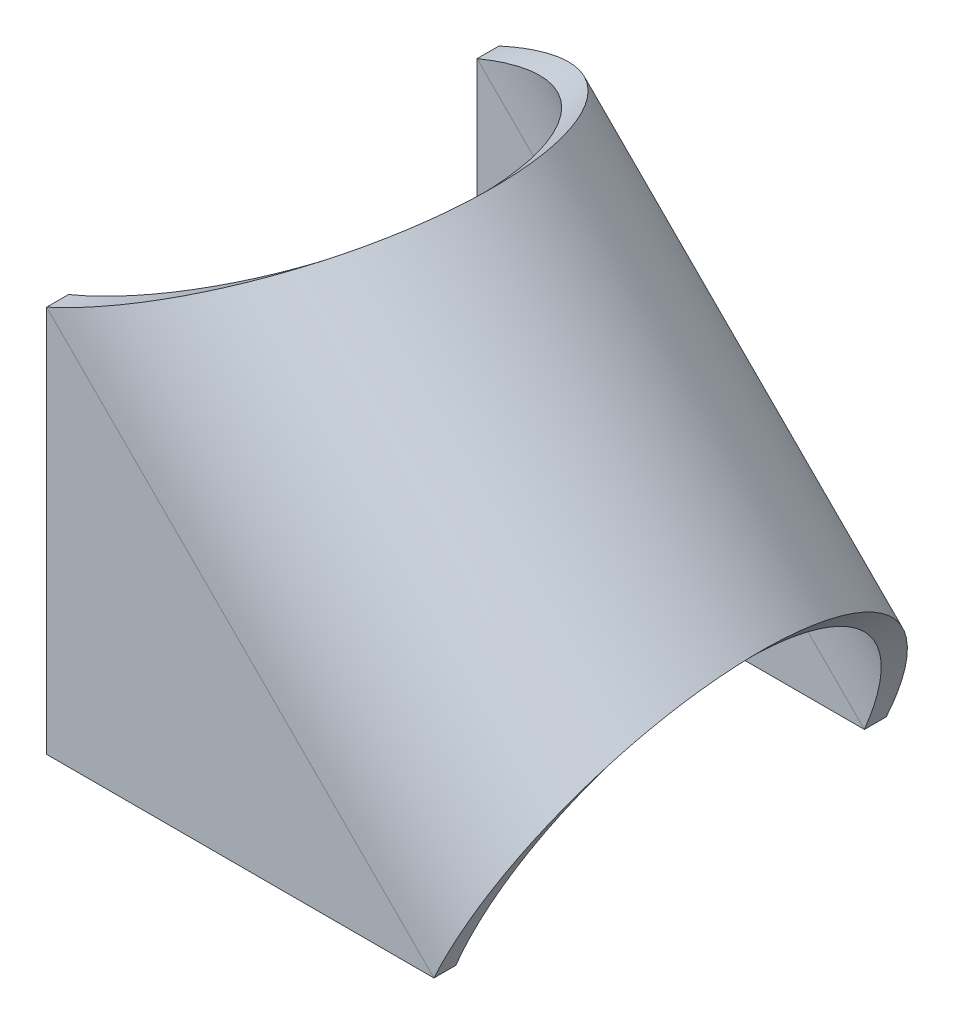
ISO-10303-21;
HEADER;
FILE_DESCRIPTION(('STEP AP214'),'2;1');
FILE_NAME('part.step','',(''),(''),'','','');
FILE_SCHEMA(('AUTOMOTIVE_DESIGN { 1 0 10303 214 1 1 1 1 }'));
ENDSEC;
DATA;
#1=APPLICATION_CONTEXT('core data for automotive mechanical design processes');
#2=APPLICATION_PROTOCOL_DEFINITION('international standard','automotive_design',2000,#1);
#3=PRODUCT_CONTEXT('',#1,'mechanical');
#4=PRODUCT('Part','Part','',(#3));
#5=PRODUCT_RELATED_PRODUCT_CATEGORY('part','',(#4));
#6=PRODUCT_DEFINITION_FORMATION('','',#4);
#7=PRODUCT_DEFINITION_CONTEXT('part definition',#1,'design');
#8=PRODUCT_DEFINITION('design','',#6,#7);
#9=PRODUCT_DEFINITION_SHAPE('','',#8);
#10=(LENGTH_UNIT() NAMED_UNIT(*) SI_UNIT(.MILLI.,.METRE.));
#11=(NAMED_UNIT(*) PLANE_ANGLE_UNIT() SI_UNIT($,.RADIAN.));
#12=(NAMED_UNIT(*) SI_UNIT($,.STERADIAN.) SOLID_ANGLE_UNIT());
#13=UNCERTAINTY_MEASURE_WITH_UNIT(LENGTH_MEASURE(1.E-05),#10,'distance_accuracy_value','');
#14=(GEOMETRIC_REPRESENTATION_CONTEXT(3) GLOBAL_UNCERTAINTY_ASSIGNED_CONTEXT((#13)) GLOBAL_UNIT_ASSIGNED_CONTEXT((#10,
#11,#12)) REPRESENTATION_CONTEXT('',''));
#15=CARTESIAN_POINT('',(0.,0.,0.));
#16=DIRECTION('',(0.,0.,1.));
#17=DIRECTION('',(1.,0.,0.));
#18=AXIS2_PLACEMENT_3D('',#15,#16,#17);
#19=CARTESIAN_POINT('',(0.,0.,-40.7917745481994));
#20=DIRECTION('',(0.,-1.,0.));
#21=DIRECTION('',(-1.,0.,0.));
#22=AXIS2_PLACEMENT_3D('',#19,#20,#21);
#23=PLANE('',#22);
#24=CARTESIAN_POINT('',(17.7282787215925,0.,10.3513698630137));
#25=CARTESIAN_POINT('',(17.7282787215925,0.,9.3513698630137));
#26=B_SPLINE_CURVE_WITH_KNOTS('',1,(#24,#25),.UNSPECIFIED.,.F.,.F.,(2,2),(0.,1.),.UNSPECIFIED.);
#27=CARTESIAN_POINT('',(17.7282787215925,0.,9.3513698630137));
#28=VERTEX_POINT('',#27);
#29=CARTESIAN_POINT('',(17.7282787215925,0.,10.3513698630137));
#30=VERTEX_POINT('',#29);
#31=EDGE_CURVE('E295',#28,#30,#26,.F.);
#32=ORIENTED_EDGE('',*,*,#31,.T.);
#33=DIRECTION('',(1.,0.,0.));
#34=VECTOR('',#33,1.);
#35=CARTESIAN_POINT('',(0.,0.,10.3513698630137));
#36=LINE('',#35,#34);
#37=CARTESIAN_POINT('',(0.,0.,10.3513698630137));
#38=VERTEX_POINT('',#37);
#39=EDGE_CURVE('E293',#38,#30,#36,.T.);
#40=ORIENTED_EDGE('',*,*,#39,.F.);
#41=DIRECTION('',(0.,0.,1.));
#42=VECTOR('',#41,1.);
#43=CARTESIAN_POINT('',(0.,0.,-40.7917745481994));
#44=LINE('',#43,#42);
#45=CARTESIAN_POINT('',(0.,0.,9.3513698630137));
#46=VERTEX_POINT('',#45);
#47=EDGE_CURVE('E49',#46,#38,#44,.T.);
#48=ORIENTED_EDGE('',*,*,#47,.F.);
#49=DIRECTION('',(1.,0.,0.));
#50=VECTOR('',#49,1.);
#51=CARTESIAN_POINT('',(0.,0.,9.3513698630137));
#52=LINE('',#51,#50);
#53=EDGE_CURVE('E76',#46,#28,#52,.T.);
#54=ORIENTED_EDGE('',*,*,#53,.T.);
#55=EDGE_LOOP('',(#32,#40,#48,#54));
#56=FACE_BOUND('',#55,.T.);
#57=ADVANCED_FACE('F37',(#56),#23,.T.);
#58=CARTESIAN_POINT('',(0.,17.7282787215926,10.3513698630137));
#59=DIRECTION('',(0.,0.,1.));
#60=DIRECTION('',(1.,0.,0.));
#61=AXIS2_PLACEMENT_3D('',#58,#59,#60);
#62=PLANE('',#61);
#63=DIRECTION('',(0.707106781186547,-0.707106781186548,0.));
#64=VECTOR('',#63,1.);
#65=CARTESIAN_POINT('',(0.,17.7282787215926,10.3513698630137));
#66=LINE('',#65,#64);
#67=CARTESIAN_POINT('',(0.,17.7282787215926,10.3513698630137));
#68=VERTEX_POINT('',#67);
#69=EDGE_CURVE('E70',#68,#30,#66,.T.);
#70=ORIENTED_EDGE('',*,*,#69,.F.);
#71=DIRECTION('',(0.,-1.,0.));
#72=VECTOR('',#71,1.);
#73=CARTESIAN_POINT('',(0.,17.7282787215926,10.3513698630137));
#74=LINE('',#73,#72);
#75=EDGE_CURVE('E299',#68,#38,#74,.T.);
#76=ORIENTED_EDGE('',*,*,#75,.T.);
#77=ORIENTED_EDGE('',*,*,#39,.T.);
#78=EDGE_LOOP('',(#70,#76,#77));
#79=FACE_BOUND('',#78,.T.);
#80=ADVANCED_FACE('F318',(#79),#62,.T.);
#81=CARTESIAN_POINT('',(0.,17.7282787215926,-40.7917745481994));
#82=DIRECTION('',(-1.,0.,0.));
#83=DIRECTION('',(0.,1.,0.));
#84=AXIS2_PLACEMENT_3D('',#81,#82,#83);
#85=PLANE('',#84);
#86=ORIENTED_EDGE('',*,*,#47,.T.);
#87=ORIENTED_EDGE('',*,*,#75,.F.);
#88=CARTESIAN_POINT('',(0.,17.7282787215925,9.3513698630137));
#89=CARTESIAN_POINT('',(0.,17.7282787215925,10.3513698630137));
#90=B_SPLINE_CURVE_WITH_KNOTS('',1,(#88,#89),.UNSPECIFIED.,.F.,.F.,(2,2),(0.,1.),.UNSPECIFIED.);
#91=CARTESIAN_POINT('',(0.,17.7282787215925,9.3513698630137));
#92=VERTEX_POINT('',#91);
#93=EDGE_CURVE('E246',#92,#68,#90,.T.);
#94=ORIENTED_EDGE('',*,*,#93,.F.);
#95=DIRECTION('',(0.,-1.,0.));
#96=VECTOR('',#95,1.);
#97=CARTESIAN_POINT('',(0.,17.7282787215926,9.3513698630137));
#98=LINE('',#97,#96);
#99=EDGE_CURVE('E13',#92,#46,#98,.T.);
#100=ORIENTED_EDGE('',*,*,#99,.T.);
#101=EDGE_LOOP('',(#86,#87,#94,#100));
#102=FACE_BOUND('',#101,.T.);
#103=ADVANCED_FACE('F310',(#102),#85,.T.);
#104=CARTESIAN_POINT('',(0.,17.7282787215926,9.3513698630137));
#105=DIRECTION('',(0.,0.,1.));
#106=DIRECTION('',(1.,0.,0.));
#107=AXIS2_PLACEMENT_3D('',#104,#105,#106);
#108=PLANE('',#107);
#109=DIRECTION('',(-0.707106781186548,0.707106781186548,0.));
#110=VECTOR('',#109,1.);
#111=CARTESIAN_POINT('',(17.7282787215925,0.,9.35136986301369));
#112=LINE('',#111,#110);
#113=EDGE_CURVE('E245',#28,#92,#112,.T.);
#114=ORIENTED_EDGE('',*,*,#113,.F.);
#115=ORIENTED_EDGE('',*,*,#53,.F.);
#116=ORIENTED_EDGE('',*,*,#99,.F.);
#117=EDGE_LOOP('',(#114,#115,#116));
#118=FACE_BOUND('',#117,.T.);
#119=ADVANCED_FACE('F39',(#118),#108,.F.);
#120=CARTESIAN_POINT('',(0.,17.7282787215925,40.7917745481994));
#121=DIRECTION('',(1.,0.,0.));
#122=DIRECTION('',(0.,1.,0.));
#123=AXIS2_PLACEMENT_3D('',#120,#121,#122);
#124=PLANE('',#123);
#125=DIRECTION('',(0.,-1.,0.));
#126=VECTOR('',#125,1.);
#127=CARTESIAN_POINT('',(0.,17.7282787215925,-10.3513698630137));
#128=LINE('',#127,#126);
#129=CARTESIAN_POINT('',(0.,17.7282787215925,-10.3513698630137));
#130=VERTEX_POINT('',#129);
#131=CARTESIAN_POINT('',(0.,0.,-10.3513698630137));
#132=VERTEX_POINT('',#131);
#133=EDGE_CURVE('E112',#130,#132,#128,.T.);
#134=ORIENTED_EDGE('',*,*,#133,.T.);
#135=DIRECTION('',(0.,0.,-1.));
#136=VECTOR('',#135,1.);
#137=CARTESIAN_POINT('',(0.,0.,40.7917745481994));
#138=LINE('',#137,#136);
#139=CARTESIAN_POINT('',(0.,0.,-9.3513698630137));
#140=VERTEX_POINT('',#139);
#141=EDGE_CURVE('E125',#140,#132,#138,.T.);
#142=ORIENTED_EDGE('',*,*,#141,.F.);
#143=DIRECTION('',(0.,-1.,0.));
#144=VECTOR('',#143,1.);
#145=CARTESIAN_POINT('',(0.,17.7282787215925,-9.3513698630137));
#146=LINE('',#145,#144);
#147=CARTESIAN_POINT('',(0.,17.7282787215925,-9.35136986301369));
#148=VERTEX_POINT('',#147);
#149=EDGE_CURVE('E91',#148,#140,#146,.T.);
#150=ORIENTED_EDGE('',*,*,#149,.F.);
#151=CARTESIAN_POINT('',(0.,17.7282787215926,-10.3513698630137));
#152=CARTESIAN_POINT('',(0.,17.7282787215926,-9.35136986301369));
#153=B_SPLINE_CURVE_WITH_KNOTS('',1,(#151,#152),.UNSPECIFIED.,.F.,.F.,(2,2),(0.,1.),.UNSPECIFIED.);
#154=EDGE_CURVE('E83',#148,#130,#153,.F.);
#155=ORIENTED_EDGE('',*,*,#154,.T.);
#156=EDGE_LOOP('',(#134,#142,#150,#155));
#157=FACE_BOUND('',#156,.T.);
#158=ADVANCED_FACE('F272',(#157),#124,.F.);
#159=CARTESIAN_POINT('',(0.,0.,40.7917745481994));
#160=DIRECTION('',(0.,1.,0.));
#161=DIRECTION('',(0.,0.,1.));
#162=AXIS2_PLACEMENT_3D('',#159,#160,#161);
#163=PLANE('',#162);
#164=DIRECTION('',(1.,0.,0.));
#165=VECTOR('',#164,1.);
#166=CARTESIAN_POINT('',(0.,0.,-10.3513698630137));
#167=LINE('',#166,#165);
#168=CARTESIAN_POINT('',(17.7282787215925,0.,-10.3513698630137));
#169=VERTEX_POINT('',#168);
#170=EDGE_CURVE('E111',#132,#169,#167,.T.);
#171=ORIENTED_EDGE('',*,*,#170,.T.);
#172=CARTESIAN_POINT('',(17.7282787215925,0.,-9.35136986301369));
#173=CARTESIAN_POINT('',(17.7282787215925,0.,-10.3513698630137));
#174=B_SPLINE_CURVE_WITH_KNOTS('',1,(#172,#173),.UNSPECIFIED.,.F.,.F.,(2,2),(0.,1.),.UNSPECIFIED.);
#175=CARTESIAN_POINT('',(17.7282787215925,0.,-9.35136986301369));
#176=VERTEX_POINT('',#175);
#177=EDGE_CURVE('E122',#176,#169,#174,.T.);
#178=ORIENTED_EDGE('',*,*,#177,.F.);
#179=DIRECTION('',(1.,0.,0.));
#180=VECTOR('',#179,1.);
#181=CARTESIAN_POINT('',(0.,0.,-9.3513698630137));
#182=LINE('',#181,#180);
#183=EDGE_CURVE('E138',#140,#176,#182,.T.);
#184=ORIENTED_EDGE('',*,*,#183,.F.);
#185=ORIENTED_EDGE('',*,*,#141,.T.);
#186=EDGE_LOOP('',(#171,#178,#184,#185));
#187=FACE_BOUND('',#186,.T.);
#188=ADVANCED_FACE('F121',(#187),#163,.F.);
#189=CARTESIAN_POINT('',(0.,17.7282787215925,-9.3513698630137));
#190=DIRECTION('',(0.,0.,-1.));
#191=DIRECTION('',(1.,0.,0.));
#192=AXIS2_PLACEMENT_3D('',#189,#190,#191);
#193=PLANE('',#192);
#194=DIRECTION('',(-0.707106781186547,0.707106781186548,0.));
#195=VECTOR('',#194,1.);
#196=CARTESIAN_POINT('',(17.7282787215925,0.,-9.35136986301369));
#197=LINE('',#196,#195);
#198=EDGE_CURVE('E288',#148,#176,#197,.F.);
#199=ORIENTED_EDGE('',*,*,#198,.F.);
#200=ORIENTED_EDGE('',*,*,#149,.T.);
#201=ORIENTED_EDGE('',*,*,#183,.T.);
#202=EDGE_LOOP('',(#199,#200,#201));
#203=FACE_BOUND('',#202,.T.);
#204=ADVANCED_FACE('F271',(#203),#193,.F.);
#205=CARTESIAN_POINT('',(0.,17.7282787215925,-10.3513698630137));
#206=DIRECTION('',(0.,0.,-1.));
#207=DIRECTION('',(1.,0.,0.));
#208=AXIS2_PLACEMENT_3D('',#205,#206,#207);
#209=PLANE('',#208);
#210=DIRECTION('',(0.707106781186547,-0.707106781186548,0.));
#211=VECTOR('',#210,1.);
#212=CARTESIAN_POINT('',(0.,17.7282787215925,-10.3513698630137));
#213=LINE('',#212,#211);
#214=EDGE_CURVE('E108',#130,#169,#213,.T.);
#215=ORIENTED_EDGE('',*,*,#214,.T.);
#216=ORIENTED_EDGE('',*,*,#170,.F.);
#217=ORIENTED_EDGE('',*,*,#133,.F.);
#218=EDGE_LOOP('',(#215,#216,#217));
#219=FACE_BOUND('',#218,.T.);
#220=ADVANCED_FACE('F110',(#219),#209,.T.);
#221=CARTESIAN_POINT('',(17.7282787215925,0.,-10.3513698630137));
#222=CARTESIAN_POINT('',(17.9204034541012,0.421877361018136,-10.3513698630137));
#223=CARTESIAN_POINT('',(18.0886068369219,0.790687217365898,-10.3244794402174));
#224=CARTESIAN_POINT('',(18.303828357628,1.26333979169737,-10.2706723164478));
#225=CARTESIAN_POINT('',(18.3694199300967,1.40748190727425,-10.2504132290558));
#226=CARTESIAN_POINT('',(18.458680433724,1.60367851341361,-10.2191745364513));
#227=CARTESIAN_POINT('',(18.4869140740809,1.66574256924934,-10.2086148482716));
#228=CARTESIAN_POINT('',(18.5270054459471,1.75385713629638,-10.1928384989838));
#229=CARTESIAN_POINT('',(18.5399927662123,1.78239845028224,-10.1875899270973));
#230=CARTESIAN_POINT('',(18.5589119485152,1.82396801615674,-10.1797649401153));
#231=CARTESIAN_POINT('',(18.5651247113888,1.83761747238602,-10.1771645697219));
#232=CARTESIAN_POINT('',(18.5743037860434,1.85778143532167,-10.1732798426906));
#233=CARTESIAN_POINT('',(18.5773401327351,1.86445105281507,-10.1719875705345));
#234=CARTESIAN_POINT('',(18.5818596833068,1.87437797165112,-10.1700535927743));
#235=CARTESIAN_POINT('',(18.583360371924,1.8776740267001,-10.1694096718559));
#236=CARTESIAN_POINT('',(18.5856026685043,1.8825987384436,-10.1684449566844));
#237=CARTESIAN_POINT('',(18.5863486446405,1.88423708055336,-10.1681235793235));
#238=CARTESIAN_POINT('',(18.5874654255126,1.88668975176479,-10.1676418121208));
#239=CARTESIAN_POINT('',(18.5878373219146,1.88750650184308,-10.1674812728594));
#240=CARTESIAN_POINT('',(18.5885803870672,1.88913838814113,-10.1671602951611));
#241=CARTESIAN_POINT('',(18.5887072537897,1.8894170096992,-10.1671055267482));
#242=CARTESIAN_POINT('',(18.7467897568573,2.23658392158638,-10.0987287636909));
#243=CARTESIAN_POINT('',(18.895232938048,2.56236467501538,-10.0152129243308));
#244=CARTESIAN_POINT('',(19.1038786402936,3.02050008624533,-9.87496307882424));
#245=CARTESIAN_POINT('',(19.1711011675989,3.16813307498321,-9.82570820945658));
#246=CARTESIAN_POINT('',(19.2684678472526,3.38198628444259,-9.74899930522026));
#247=CARTESIAN_POINT('',(19.3003460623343,3.45200514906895,-9.72295794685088));
#248=CARTESIAN_POINT('',(19.3473043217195,3.55514209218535,-9.68329895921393));
#249=CARTESIAN_POINT('',(19.3628139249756,3.58920587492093,-9.66997976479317));
#250=CARTESIAN_POINT('',(19.3858647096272,3.63982985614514,-9.64986514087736));
#251=CARTESIAN_POINT('',(19.3935127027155,3.65662590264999,-9.64313762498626));
#252=CARTESIAN_POINT('',(19.404931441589,3.6817022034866,-9.63301404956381));
#253=CARTESIAN_POINT('',(19.4087288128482,3.6900413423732,-9.62963414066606));
#254=CARTESIAN_POINT('',(19.414411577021,3.70252062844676,-9.62455640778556));
#255=CARTESIAN_POINT('',(19.4163036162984,3.70667548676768,-9.62286251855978));
#256=CARTESIAN_POINT('',(19.4191383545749,3.71290042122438,-9.62031974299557));
#257=CARTESIAN_POINT('',(19.4200827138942,3.71497417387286,-9.61947182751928));
#258=CARTESIAN_POINT('',(19.4219703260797,3.71911922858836,-9.61777535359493));
#259=CARTESIAN_POINT('',(19.4226790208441,3.72067546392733,-9.61713800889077));
#260=CARTESIAN_POINT('',(19.725234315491,4.38505739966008,-9.34469448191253));
#261=CARTESIAN_POINT('',(20.0003621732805,4.98777315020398,-9.0134702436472));
#262=CARTESIAN_POINT('',(20.3700388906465,5.79958541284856,-8.46367751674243));
#263=CARTESIAN_POINT('',(20.4861833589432,6.05490068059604,-8.27154358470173));
#264=CARTESIAN_POINT('',(20.6500051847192,6.41516713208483,-7.97415531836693));
#265=CARTESIAN_POINT('',(20.7028841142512,6.53147567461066,-7.87349083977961));
#266=CARTESIAN_POINT('',(20.7796721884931,6.70033027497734,-7.72067012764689));
#267=CARTESIAN_POINT('',(20.8048467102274,6.75568065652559,-7.66942563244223));
#268=CARTESIAN_POINT('',(20.8419858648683,6.83731412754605,-7.59215996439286));
#269=CARTESIAN_POINT('',(20.8542618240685,6.8642932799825,-7.56633823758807));
#270=CARTESIAN_POINT('',(20.8725214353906,6.9044153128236,-7.52751292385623));
#271=CARTESIAN_POINT('',(20.8785822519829,6.91773154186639,-7.51455569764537));
#272=CARTESIAN_POINT('',(20.8876350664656,6.93761938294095,-7.49509754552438));
#273=CARTESIAN_POINT('',(20.8906462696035,6.94423424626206,-7.48860777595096));
#274=CARTESIAN_POINT('',(20.8951534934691,6.95413493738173,-7.47886765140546));
#275=CARTESIAN_POINT('',(20.8966543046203,6.95743156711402,-7.47562003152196));
#276=CARTESIAN_POINT('',(20.8996527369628,6.96401762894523,-7.4691229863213));
#277=CARTESIAN_POINT('',(20.9008582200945,6.96666541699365,-7.46650826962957));
#278=CARTESIAN_POINT('',(21.1315316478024,7.47331022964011,-6.96533969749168));
#279=CARTESIAN_POINT('',(21.3327398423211,7.91425314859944,-6.42509764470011));
#280=CARTESIAN_POINT('',(21.5907111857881,8.48068055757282,-5.57606413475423));
#281=CARTESIAN_POINT('',(21.6694447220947,8.65370844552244,-5.28658887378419));
#282=CARTESIAN_POINT('',(21.776777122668,8.88969586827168,-4.84567552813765));
#283=CARTESIAN_POINT('',(21.8107625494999,8.9644352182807,-4.69758582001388));
#284=CARTESIAN_POINT('',(21.8590894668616,9.07069639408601,-4.47412990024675));
#285=CARTESIAN_POINT('',(21.874756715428,9.10514229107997,-4.39942423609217));
#286=CARTESIAN_POINT('',(21.8976008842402,9.15535527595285,-4.2870785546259));
#287=CARTESIAN_POINT('',(21.9051061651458,9.17185030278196,-4.24958212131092));
#288=CARTESIAN_POINT('',(21.9162007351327,9.19622970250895,-4.19327100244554));
#289=CARTESIAN_POINT('',(21.9198717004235,9.20429564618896,-4.17448955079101));
#290=CARTESIAN_POINT('',(21.9253374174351,9.21630388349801,-4.14630141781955));
#291=CARTESIAN_POINT('',(21.9271525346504,9.22029151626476,-4.13690271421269));
#292=CARTESIAN_POINT('',(21.9307692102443,9.22823657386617,-4.11810009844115));
#293=CARTESIAN_POINT('',(21.9324161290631,9.23185432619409,-4.10950665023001));
#294=CARTESIAN_POINT('',(22.059128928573,9.51018449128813,-3.44540649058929));
#295=CARTESIAN_POINT('',(22.153302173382,9.71632143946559,-2.76685929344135));
#296=CARTESIAN_POINT('',(22.2781574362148,9.99046193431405,-1.39053044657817));
#297=CARTESIAN_POINT('',(22.3088528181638,10.0584788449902,-0.692665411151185));
#298=CARTESIAN_POINT('',(22.308847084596,10.058473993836,0.692777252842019));
#299=CARTESIAN_POINT('',(22.2781651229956,9.99046875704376,1.39045618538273));
#300=CARTESIAN_POINT('',(22.1845313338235,9.78486448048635,2.42270894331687));
#301=CARTESIAN_POINT('',(22.1454171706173,9.69909589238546,2.76440046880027));
#302=CARTESIAN_POINT('',(22.0749965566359,9.54469724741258,3.27053872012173));
#303=CARTESIAN_POINT('',(22.049566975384,9.48894225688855,3.43818450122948));
#304=CARTESIAN_POINT('',(22.0085216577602,9.3989097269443,3.68769863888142));
#305=CARTESIAN_POINT('',(21.9943565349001,9.36783235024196,3.77054424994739));
#306=CARTESIAN_POINT('',(21.9723892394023,9.31962189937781,3.89427968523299));
#307=CARTESIAN_POINT('',(21.9649468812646,9.30328602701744,3.93543599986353));
#308=CARTESIAN_POINT('',(21.9536042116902,9.27838439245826,3.99703168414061));
#309=CARTESIAN_POINT('',(21.9497934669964,9.27001754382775,4.01754044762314));
#310=CARTESIAN_POINT('',(21.9440326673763,9.25736791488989,4.04826820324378));
#311=CARTESIAN_POINT('',(21.9421049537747,9.2531348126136,4.05850489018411));
#312=CARTESIAN_POINT('',(21.9382346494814,9.24463550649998,4.07896635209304));
#313=CARTESIAN_POINT('',(21.9361366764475,9.24002804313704,4.0900053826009));
#314=CARTESIAN_POINT('',(21.8194851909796,8.98383142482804,4.70129825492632));
#315=CARTESIAN_POINT('',(21.6767079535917,8.66953399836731,5.2929920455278));
#316=CARTESIAN_POINT('',(21.4187471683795,8.10311007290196,6.14202426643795));
#317=CARTESIAN_POINT('',(21.3254986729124,7.89851005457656,6.41858280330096));
#318=CARTESIAN_POINT('',(21.1748751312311,7.56806351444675,6.82057946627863));
#319=CARTESIAN_POINT('',(21.1228783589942,7.45399312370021,6.95243660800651));
#320=CARTESIAN_POINT('',(21.0422446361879,7.27705004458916,7.14660222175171));
#321=CARTESIAN_POINT('',(21.0149271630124,7.21709629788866,7.21072066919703));
#322=CARTESIAN_POINT('',(20.973299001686,7.12571399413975,7.30594166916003));
#323=CARTESIAN_POINT('',(20.959314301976,7.0950112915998,7.33752255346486));
#324=CARTESIAN_POINT('',(20.9381753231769,7.04859537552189,7.38464823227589));
#325=CARTESIAN_POINT('',(20.93110200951,7.03306309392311,7.40031585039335));
#326=CARTESIAN_POINT('',(20.920451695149,7.00967434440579,7.42375505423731));
#327=CARTESIAN_POINT('',(20.9168948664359,7.00186304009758,7.43155775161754));
#328=CARTESIAN_POINT('',(20.9115495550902,6.99012351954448,7.44324614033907));
#329=CARTESIAN_POINT('',(20.9097661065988,6.98620658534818,7.44713966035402));
#330=CARTESIAN_POINT('',(20.906195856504,6.97836519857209,7.4549214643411));
#331=CARTESIAN_POINT('',(20.9041195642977,6.97380490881,7.4594386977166));
#332=CARTESIAN_POINT('',(20.7107503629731,6.54908878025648,7.87955404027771));
#333=CARTESIAN_POINT('',(20.4925708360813,6.06875900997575,8.28154518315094));
#334=CARTESIAN_POINT('',(20.1228285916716,5.2568963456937,8.83117634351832));
#335=CARTESIAN_POINT('',(19.9925574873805,4.97110259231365,9.0054290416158));
#336=CARTESIAN_POINT('',(19.7868413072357,4.51987867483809,9.24897182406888));
#337=CARTESIAN_POINT('',(19.7165557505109,4.36571991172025,9.32717682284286));
#338=CARTESIAN_POINT('',(19.6086315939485,4.12893000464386,9.43944488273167));
#339=CARTESIAN_POINT('',(19.5722412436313,4.0490750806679,9.47602750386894));
#340=CARTESIAN_POINT('',(19.5170447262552,3.92791771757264,9.52956808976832));
#341=CARTESIAN_POINT('',(19.4985440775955,3.88730278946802,9.54719271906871));
#342=CARTESIAN_POINT('',(19.4706421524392,3.82603844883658,9.57328708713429));
#343=CARTESIAN_POINT('',(19.4613163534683,3.80556001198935,9.58192811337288));
#344=CARTESIAN_POINT('',(19.4472901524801,3.77475710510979,9.59480285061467));
#345=CARTESIAN_POINT('',(19.4426085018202,3.76447526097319,9.59907996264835));
#346=CARTESIAN_POINT('',(19.4355766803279,3.74903121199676,9.60547378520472));
#347=CARTESIAN_POINT('',(19.4332311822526,3.74387964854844,9.60760141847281));
#348=CARTESIAN_POINT('',(19.4297106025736,3.73614698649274,9.61078738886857));
#349=CARTESIAN_POINT('',(19.4285366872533,3.73356854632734,9.61184846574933));
#350=CARTESIAN_POINT('',(19.4261880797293,3.72840989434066,9.61396878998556));
#351=CARTESIAN_POINT('',(19.4247830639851,3.72532377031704,9.61523547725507));
#352=CARTESIAN_POINT('',(19.3029094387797,3.45762488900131,9.72500043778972));
#353=CARTESIAN_POINT('',(19.1730007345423,3.17220434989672,9.82854988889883));
#354=CARTESIAN_POINT('',(18.9643499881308,2.71406034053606,9.9687498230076));
#355=CARTESIAN_POINT('',(18.8925087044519,2.55635038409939,10.0129524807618));
#356=CARTESIAN_POINT('',(18.7813438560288,2.31232614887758,10.0744904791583));
#357=CARTESIAN_POINT('',(18.743722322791,2.22974209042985,10.0942082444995));
#358=CARTESIAN_POINT('',(18.6864498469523,2.10401173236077,10.1224663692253));
#359=CARTESIAN_POINT('',(18.6672190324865,2.06179260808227,10.1316659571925));
#360=CARTESIAN_POINT('',(18.6381644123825,1.99800199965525,10.1451195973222));
#361=CARTESIAN_POINT('',(18.6284448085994,1.97666147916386,10.1495465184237));
#362=CARTESIAN_POINT('',(18.6138135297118,1.94453544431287,10.1560984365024));
#363=CARTESIAN_POINT('',(18.6089277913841,1.93380755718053,10.1582676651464));
#364=CARTESIAN_POINT('',(18.60158624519,1.91768694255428,10.1614991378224));
#365=CARTESIAN_POINT('',(18.5991369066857,1.91230860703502,10.1625725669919));
#366=CARTESIAN_POINT('',(18.5954596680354,1.90423391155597,10.1641770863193));
#367=CARTESIAN_POINT('',(18.594233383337,1.90154114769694,10.1647109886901));
#368=CARTESIAN_POINT('',(18.5923931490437,1.89750020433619,10.1655104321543));
#369=CARTESIAN_POINT('',(18.5917796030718,1.89615292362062,10.1657766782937));
#370=CARTESIAN_POINT('',(18.590552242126,1.89345776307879,10.1663086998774));
#371=CARTESIAN_POINT('',(18.5896935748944,1.8915722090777,10.1666803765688));
#372=CARTESIAN_POINT('',(18.4948356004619,1.68327238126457,10.2077074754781));
#373=CARTESIAN_POINT('',(18.3762355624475,1.42236245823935,10.2525207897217));
#374=CARTESIAN_POINT('',(18.0892803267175,0.792168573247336,10.3243591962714));
#375=CARTESIAN_POINT('',(17.920854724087,0.422868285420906,10.3513698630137));
#376=CARTESIAN_POINT('',(17.7282787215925,0.,10.3513698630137));
#377=CARTESIAN_POINT('',(17.7282787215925,0.,-9.35136986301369));
#378=CARTESIAN_POINT('',(17.8907444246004,0.392216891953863,-9.35136986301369));
#379=CARTESIAN_POINT('',(18.0330095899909,0.735089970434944,-9.32707720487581));
#380=CARTESIAN_POINT('',(18.2150048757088,1.17451630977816,-9.27846814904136));
#381=CARTESIAN_POINT('',(18.2704657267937,1.30852770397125,-9.26016620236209));
#382=CARTESIAN_POINT('',(18.3459378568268,1.49093593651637,-9.23194534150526));
#383=CARTESIAN_POINT('',(18.3698098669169,1.54863836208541,-9.22240577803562));
#384=CARTESIAN_POINT('',(18.4037085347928,1.63056022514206,-9.20815351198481));
#385=CARTESIAN_POINT('',(18.4146899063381,1.65709559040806,-9.20341198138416));
#386=CARTESIAN_POINT('',(18.4306873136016,1.69574338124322,-9.19634293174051));
#387=CARTESIAN_POINT('',(18.4359406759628,1.70843343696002,-9.19399377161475));
#388=CARTESIAN_POINT('',(18.4437024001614,1.72718004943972,-9.19048433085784));
#389=CARTESIAN_POINT('',(18.4462699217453,1.73338084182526,-9.18931689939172));
#390=CARTESIAN_POINT('',(18.4500916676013,1.74260995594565,-9.18756975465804));
#391=CARTESIAN_POINT('',(18.4513606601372,1.74567431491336,-9.1869880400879));
#392=CARTESIAN_POINT('',(18.4532567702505,1.75025284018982,-9.18611652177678));
#393=CARTESIAN_POINT('',(18.4538875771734,1.75177601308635,-9.1858261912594));
#394=CARTESIAN_POINT('',(18.4548319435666,1.75405626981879,-9.18539096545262));
#395=CARTESIAN_POINT('',(18.4551464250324,1.75481560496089,-9.18524593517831));
#396=CARTESIAN_POINT('',(18.4557747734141,1.75633277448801,-9.18495596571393));
#397=CARTESIAN_POINT('',(18.4558820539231,1.75659180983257,-9.1849064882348));
#398=CARTESIAN_POINT('',(18.5895596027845,2.07935376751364,-9.12313530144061));
#399=CARTESIAN_POINT('',(18.7150964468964,2.38222818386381,-9.04768755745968));
#400=CARTESIAN_POINT('',(18.8915347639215,2.80815620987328,-8.92098662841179));
#401=CARTESIAN_POINT('',(18.9483791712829,2.9454110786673,-8.87649005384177));
#402=CARTESIAN_POINT('',(19.0307130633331,3.14423150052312,-8.80719165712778));
#403=CARTESIAN_POINT('',(19.0576693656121,3.2093284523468,-8.78366603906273));
#404=CARTESIAN_POINT('',(19.0973776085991,3.30521537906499,-8.74783833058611));
#405=CARTESIAN_POINT('',(19.1104926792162,3.33688462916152,-8.73580584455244));
#406=CARTESIAN_POINT('',(19.1299847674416,3.38394991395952,-8.71763440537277));
#407=CARTESIAN_POINT('',(19.1364520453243,3.39956524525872,-8.71155680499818));
#408=CARTESIAN_POINT('',(19.1461079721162,3.42287873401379,-8.70241122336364));
#409=CARTESIAN_POINT('',(19.1493191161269,3.43063164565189,-8.69935783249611));
#410=CARTESIAN_POINT('',(19.1541246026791,3.44223365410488,-8.69477063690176));
#411=CARTESIAN_POINT('',(19.1557245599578,3.44609643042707,-8.69324038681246));
#412=CARTESIAN_POINT('',(19.1581216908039,3.45188375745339,-8.69094325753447));
#413=CARTESIAN_POINT('',(19.1589202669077,3.45381172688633,-8.69017725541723));
#414=CARTESIAN_POINT('',(19.1605164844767,3.45766538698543,-8.68864467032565));
#415=CARTESIAN_POINT('',(19.1611157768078,3.45911221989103,-8.6880688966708));
#416=CARTESIAN_POINT('',(19.4169653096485,4.07678839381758,-8.44194493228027));
#417=CARTESIAN_POINT('',(19.6496908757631,4.63710185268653,-8.14271880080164));
#418=CARTESIAN_POINT('',(19.9622983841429,5.39184490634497,-7.6460391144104));
#419=CARTESIAN_POINT('',(20.0605003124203,5.6292176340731,-7.4724663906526));
#420=CARTESIAN_POINT('',(20.1990072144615,5.96416916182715,-7.20380748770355));
#421=CARTESIAN_POINT('',(20.2437139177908,6.07230547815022,-7.11286775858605));
#422=CARTESIAN_POINT('',(20.3086367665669,6.22929485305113,-6.97481037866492));
#423=CARTESIAN_POINT('',(20.3299217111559,6.28075565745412,-6.92851638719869));
#424=CARTESIAN_POINT('',(20.3613238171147,6.35665207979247,-6.85871501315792));
#425=CARTESIAN_POINT('',(20.3717036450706,6.38173510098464,-6.83538780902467));
#426=CARTESIAN_POINT('',(20.387143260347,6.41903713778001,-6.80031323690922));
#427=CARTESIAN_POINT('',(20.3922681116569,6.43141740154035,-6.78860775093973));
#428=CARTESIAN_POINT('',(20.3999230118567,6.44990732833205,-6.77102936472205));
#429=CARTESIAN_POINT('',(20.4024692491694,6.45605722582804,-6.76516654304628));
#430=CARTESIAN_POINT('',(20.4062805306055,6.46526197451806,-6.75636736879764));
#431=CARTESIAN_POINT('',(20.4075496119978,6.46832687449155,-6.75343348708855));
#432=CARTESIAN_POINT('',(20.4100850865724,6.47444997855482,-6.74756409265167));
#433=CARTESIAN_POINT('',(20.4111044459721,6.47691164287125,-6.74520197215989));
#434=CARTESIAN_POINT('',(20.6061633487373,6.94794193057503,-6.29244907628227));
#435=CARTESIAN_POINT('',(20.7763538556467,7.3578671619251,-5.80439741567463));
#436=CARTESIAN_POINT('',(20.9945044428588,7.8844738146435,-5.03738527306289));
#437=CARTESIAN_POINT('',(21.0610772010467,8.04534092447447,-4.77587493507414));
#438=CARTESIAN_POINT('',(21.151826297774,8.26474504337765,-4.3775562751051));
#439=CARTESIAN_POINT('',(21.1805600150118,8.33423268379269,-4.24377285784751));
#440=CARTESIAN_POINT('',(21.2214198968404,8.43302682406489,-4.0419040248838));
#441=CARTESIAN_POINT('',(21.2346665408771,8.46505211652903,-3.97441534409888));
#442=CARTESIAN_POINT('',(21.2539818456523,8.51173623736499,-3.87292288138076));
#443=CARTESIAN_POINT('',(21.2603278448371,8.5270719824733,-3.83904881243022));
#444=CARTESIAN_POINT('',(21.2697089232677,8.54973789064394,-3.78817766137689));
#445=CARTESIAN_POINT('',(21.2728129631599,8.55723690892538,-3.77121060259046));
#446=CARTESIAN_POINT('',(21.2774346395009,8.56840110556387,-3.74574560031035));
#447=CARTESIAN_POINT('',(21.2789694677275,8.57210844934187,-3.7372548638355));
#448=CARTESIAN_POINT('',(21.2820276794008,8.57949504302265,-3.72026868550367));
#449=CARTESIAN_POINT('',(21.2834202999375,8.58285849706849,-3.71250541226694));
#450=CARTESIAN_POINT('',(21.3905683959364,8.84162395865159,-3.11256102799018));
#451=CARTESIAN_POINT('',(21.4702358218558,9.03325508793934,-2.49956527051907));
#452=CARTESIAN_POINT('',(21.5758184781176,9.28812297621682,-1.25619745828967));
#453=CARTESIAN_POINT('',(21.6017457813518,9.35137180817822,-0.625750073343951));
#454=CARTESIAN_POINT('',(21.6017405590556,9.35136746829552,0.625851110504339));
#455=CARTESIAN_POINT('',(21.5758254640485,9.28812909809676,1.25613037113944));
#456=CARTESIAN_POINT('',(21.496645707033,9.09697885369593,2.18866176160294));
#457=CARTESIAN_POINT('',(21.4635637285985,9.01724245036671,2.49734398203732));
#458=CARTESIAN_POINT('',(21.4040025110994,8.8737032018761,2.95458645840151));
#459=CARTESIAN_POINT('',(21.3824943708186,8.82186965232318,3.10603672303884));
#460=CARTESIAN_POINT('',(21.3477804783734,8.73816854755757,3.33144640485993));
#461=CARTESIAN_POINT('',(21.3358006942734,8.70927650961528,3.406288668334));
#462=CARTESIAN_POINT('',(21.3172231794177,8.66445583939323,3.51807057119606));
#463=CARTESIAN_POINT('',(21.3109293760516,8.64926852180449,3.55525095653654));
#464=CARTESIAN_POINT('',(21.301337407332,8.62611758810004,3.61089615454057));
#465=CARTESIAN_POINT('',(21.2981148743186,8.61833895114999,3.62942365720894));
#466=CARTESIAN_POINT('',(21.2932433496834,8.60657859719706,3.65718294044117));
#467=CARTESIAN_POINT('',(21.2916132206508,8.60264307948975,3.66643070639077));
#468=CARTESIAN_POINT('',(21.288340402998,8.59474126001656,3.68491547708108));
#469=CARTESIAN_POINT('',(21.2865663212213,8.5904576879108,3.69488807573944));
#470=CARTESIAN_POINT('',(21.1879244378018,8.35227067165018,4.2471266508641));
#471=CARTESIAN_POINT('',(21.067225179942,8.06005122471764,4.78165952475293));
#472=CARTESIAN_POINT('',(20.8490844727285,7.53344737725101,5.54867050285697));
#473=CARTESIAN_POINT('',(20.7702228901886,7.34323427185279,5.79851194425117));
#474=CARTESIAN_POINT('',(20.6428363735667,7.03602475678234,6.1616734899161));
#475=CARTESIAN_POINT('',(20.5988611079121,6.92997587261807,6.28079249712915));
#476=CARTESIAN_POINT('',(20.5306690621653,6.76547447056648,6.45620063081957));
#477=CARTESIAN_POINT('',(20.5075670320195,6.70973616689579,6.51412487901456));
#478=CARTESIAN_POINT('',(20.472363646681,6.62477863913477,6.60014699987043));
#479=CARTESIAN_POINT('',(20.4605374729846,6.59623446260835,6.62867699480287));
#480=CARTESIAN_POINT('',(20.4426615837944,6.5530816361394,6.67125007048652));
#481=CARTESIAN_POINT('',(20.4366801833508,6.53864126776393,6.68540410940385));
#482=CARTESIAN_POINT('',(20.4276740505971,6.51689669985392,6.70657895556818));
#483=CARTESIAN_POINT('',(20.424666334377,6.50963450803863,6.71362786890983));
#484=CARTESIAN_POINT('',(20.4201462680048,6.49872023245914,6.72418709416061));
#485=CARTESIAN_POINT('',(20.4186381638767,6.49507864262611,6.72770447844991));
#486=CARTESIAN_POINT('',(20.4156191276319,6.48778846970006,6.73473451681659));
#487=CARTESIAN_POINT('',(20.4138634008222,6.48354874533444,6.73881536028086));
#488=CARTESIAN_POINT('',(20.2503494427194,6.08868786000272,7.11834522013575));
#489=CARTESIAN_POINT('',(20.0659098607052,5.64209803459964,7.48150177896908));
#490=CARTESIAN_POINT('',(19.7532424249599,4.88731017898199,7.97803550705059));
#491=CARTESIAN_POINT('',(19.6430684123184,4.6216135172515,8.13545442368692));
#492=CARTESIAN_POINT('',(19.4690842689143,4.20212163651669,8.35546961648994));
#493=CARTESIAN_POINT('',(19.4096399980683,4.05880415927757,8.42611957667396));
#494=CARTESIAN_POINT('',(19.3183664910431,3.83866490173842,8.52754191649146));
#495=CARTESIAN_POINT('',(19.2875911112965,3.7644249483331,8.56059045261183));
#496=CARTESIAN_POINT('',(19.2409129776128,3.65178596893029,8.60895871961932));
#497=CARTESIAN_POINT('',(19.225267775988,3.61402648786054,8.6248807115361));
#498=CARTESIAN_POINT('',(19.201672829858,3.55706912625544,8.64845421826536));
#499=CARTESIAN_POINT('',(19.1937866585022,3.53803031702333,8.65626047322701));
#500=CARTESIAN_POINT('',(19.1819258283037,3.50939278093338,8.66789143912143));
#501=CARTESIAN_POINT('',(19.177966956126,3.49983371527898,8.67175535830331));
#502=CARTESIAN_POINT('',(19.172020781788,3.48547531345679,8.67753150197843));
#503=CARTESIAN_POINT('',(19.1700374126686,3.4806858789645,8.67945359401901));
#504=CARTESIAN_POINT('',(19.1670603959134,3.47349677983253,8.68233178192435));
#505=CARTESIAN_POINT('',(19.1660677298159,3.47109958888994,8.68329035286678));
#506=CARTESIAN_POINT('',(19.1640817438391,3.46630355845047,8.6852058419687));
#507=CARTESIAN_POINT('',(19.1628936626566,3.46343436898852,8.68635016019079));
#508=CARTESIAN_POINT('',(19.0598374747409,3.21455292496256,8.78551121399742));
#509=CARTESIAN_POINT('',(18.9499903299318,2.94919394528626,8.87905721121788));
#510=CARTESIAN_POINT('',(18.7735476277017,2.52325798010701,9.00571305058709));
#511=CARTESIAN_POINT('',(18.712794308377,2.37663598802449,9.04564548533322));
#512=CARTESIAN_POINT('',(18.6187860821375,2.14976837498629,9.10123857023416));
#513=CARTESIAN_POINT('',(18.5869708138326,2.07299058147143,9.11905148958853));
#514=CARTESIAN_POINT('',(18.5385378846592,1.95609977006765,9.14457972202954));
#515=CARTESIAN_POINT('',(18.5222752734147,1.91684884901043,9.15289057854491));
#516=CARTESIAN_POINT('',(18.4977053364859,1.85754292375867,9.16504452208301));
#517=CARTESIAN_POINT('',(18.4894860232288,1.83770269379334,9.16904377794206));
#518=CARTESIAN_POINT('',(18.4771132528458,1.8078351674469,9.17496274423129));
#519=CARTESIAN_POINT('',(18.4729816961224,1.79786146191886,9.17692241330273));
#520=CARTESIAN_POINT('',(18.4667734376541,1.78287413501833,9.17984170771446));
#521=CARTESIAN_POINT('',(18.4647021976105,1.77787389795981,9.18081143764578));
#522=CARTESIAN_POINT('',(18.4615926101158,1.77036685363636,9.18226095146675));
#523=CARTESIAN_POINT('',(18.4605556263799,1.76786339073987,9.18274327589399));
#524=CARTESIAN_POINT('',(18.4589994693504,1.76410652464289,9.1834654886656));
#525=CARTESIAN_POINT('',(18.4584806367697,1.76285395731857,9.18370601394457));
#526=CARTESIAN_POINT('',(18.4574427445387,1.76034826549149,9.18418663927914));
#527=CARTESIAN_POINT('',(18.4567166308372,1.75859526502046,9.18452240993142));
#528=CARTESIAN_POINT('',(18.3765020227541,1.56493880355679,9.22158606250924));
#529=CARTESIAN_POINT('',(18.2762333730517,1.32236026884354,9.26207016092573));
#530=CARTESIAN_POINT('',(18.0335789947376,0.736467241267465,9.32696857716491));
#531=CARTESIAN_POINT('',(17.8911260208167,0.393138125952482,9.3513698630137));
#532=CARTESIAN_POINT('',(17.7282787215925,0.,9.3513698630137));
#533=B_SPLINE_SURFACE_WITH_KNOTS('',1,3,((#221,#222,#223,#224,#225,#226,#227,#228,#229,#230,
#231,#232,#233,#234,#235,#236,#237,#238,#239,#240,#241,#242,#243,#244,#245,#246,#247,#248,#249,
#250,#251,#252,#253,#254,#255,#256,#257,#258,#259,#260,#261,#262,#263,#264,#265,#266,#267,#268,
#269,#270,#271,#272,#273,#274,#275,#276,#277,#278,#279,#280,#281,#282,#283,#284,#285,#286,#287,
#288,#289,#290,#291,#292,#293,#294,#295,#296,#297,#298,#299,#300,#301,#302,#303,#304,#305,#306,
#307,#308,#309,#310,#311,#312,#313,#314,#315,#316,#317,#318,#319,#320,#321,#322,#323,#324,#325,
#326,#327,#328,#329,#330,#331,#332,#333,#334,#335,#336,#337,#338,#339,#340,#341,#342,#343,#344,
#345,#346,#347,#348,#349,#350,#351,#352,#353,#354,#355,#356,#357,#358,#359,#360,#361,#362,#363,
#364,#365,#366,#367,#368,#369,#370,#371,#372,#373,#374,#375,#376),(#377,#378,#379,#380,#381,
#382,#383,#384,#385,#386,#387,#388,#389,#390,#391,#392,#393,#394,#395,#396,#397,#398,#399,#400,
#401,#402,#403,#404,#405,#406,#407,#408,#409,#410,#411,#412,#413,#414,#415,#416,#417,#418,#419,
#420,#421,#422,#423,#424,#425,#426,#427,#428,#429,#430,#431,#432,#433,#434,#435,#436,#437,#438,
#439,#440,#441,#442,#443,#444,#445,#446,#447,#448,#449,#450,#451,#452,#453,#454,#455,#456,#457,
#458,#459,#460,#461,#462,#463,#464,#465,#466,#467,#468,#469,#470,#471,#472,#473,#474,#475,#476,
#477,#478,#479,#480,#481,#482,#483,#484,#485,#486,#487,#488,#489,#490,#491,#492,#493,#494,#495,
#496,#497,#498,#499,#500,#501,#502,#503,#504,#505,#506,#507,#508,#509,#510,#511,#512,#513,#514,
#515,#516,#517,#518,#519,#520,#521,#522,#523,#524,#525,#526,#527,#528,#529,#530,#531,#532)),
.UNSPECIFIED.,.F.,.F.,.F.,(2,2),(4,2,2,2,2,2,2,2,2,2,2,2,2,2,2,2,2,2,2,2,2,2,2,2,2,2,2,2,2,2,2,
2,2,2,2,2,2,2,2,2,2,2,2,2,2,2,2,2,2,2,2,2,2,2,2,2,2,2,2,2,2,2,2,2,2,2,2,2,2,2,2,2,2,2,2,2,2,4),
(0.,1.),(0.,0.03125,0.046875,0.0546875,0.05859375,0.060546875,0.0615234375,0.06201171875,
0.062255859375,0.0623779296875,0.0625,0.09375,0.109375,0.1171875,0.12109375,0.123046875,
0.1240234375,0.12451171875,0.124755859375,0.125,0.1875,0.21875,0.234375,0.2421875,0.24609375,
0.248046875,0.2490234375,0.24951171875,0.25,0.3125,0.34375,0.359375,0.3671875,0.37109375,
0.373046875,0.3740234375,0.375,0.4375,0.5,0.5625,0.59375,0.609375,0.6171875,0.62109375,
0.623046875,0.6240234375,0.625,0.6875,0.71875,0.734375,0.7421875,0.74609375,0.748046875,
0.7490234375,0.74951171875,0.75,0.8125,0.84375,0.859375,0.8671875,0.87109375,0.873046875,
0.8740234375,0.87451171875,0.874755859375,0.875,0.90625,0.921875,0.9296875,0.93359375,
0.935546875,0.9365234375,0.93701171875,0.937255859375,0.9373779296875,0.9375,0.96875,1.),.UNSPECIFIED.);
#534=CARTESIAN_POINT('',(17.7282787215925,0.,9.3513698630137));
#535=CARTESIAN_POINT('',(17.8911260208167,0.393138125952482,9.3513698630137));
#536=CARTESIAN_POINT('',(18.0335789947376,0.736467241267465,9.32696857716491));
#537=CARTESIAN_POINT('',(18.2762333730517,1.32236026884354,9.26207016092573));
#538=CARTESIAN_POINT('',(18.3765020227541,1.56493880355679,9.22158606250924));
#539=CARTESIAN_POINT('',(18.4567166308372,1.75859526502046,9.18452240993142));
#540=CARTESIAN_POINT('',(18.4574427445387,1.76034826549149,9.18418663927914));
#541=CARTESIAN_POINT('',(18.4584806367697,1.76285395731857,9.18370601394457));
#542=CARTESIAN_POINT('',(18.4589994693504,1.76410652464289,9.1834654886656));
#543=CARTESIAN_POINT('',(18.4605556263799,1.76786339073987,9.18274327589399));
#544=CARTESIAN_POINT('',(18.4615926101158,1.77036685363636,9.18226095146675));
#545=CARTESIAN_POINT('',(18.4647021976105,1.77787389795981,9.18081143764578));
#546=CARTESIAN_POINT('',(18.4667734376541,1.78287413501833,9.17984170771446));
#547=CARTESIAN_POINT('',(18.4729816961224,1.79786146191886,9.17692241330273));
#548=CARTESIAN_POINT('',(18.4771132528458,1.8078351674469,9.17496274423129));
#549=CARTESIAN_POINT('',(18.4894860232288,1.83770269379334,9.16904377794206));
#550=CARTESIAN_POINT('',(18.4977053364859,1.85754292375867,9.16504452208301));
#551=CARTESIAN_POINT('',(18.5222752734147,1.91684884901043,9.15289057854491));
#552=CARTESIAN_POINT('',(18.5385378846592,1.95609977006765,9.14457972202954));
#553=CARTESIAN_POINT('',(18.5869708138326,2.07299058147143,9.11905148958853));
#554=CARTESIAN_POINT('',(18.6187860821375,2.14976837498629,9.10123857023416));
#555=CARTESIAN_POINT('',(18.712794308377,2.37663598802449,9.04564548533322));
#556=CARTESIAN_POINT('',(18.7735476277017,2.52325798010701,9.00571305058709));
#557=CARTESIAN_POINT('',(18.9499903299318,2.94919394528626,8.87905721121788));
#558=CARTESIAN_POINT('',(19.0598374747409,3.21455292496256,8.78551121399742));
#559=CARTESIAN_POINT('',(19.1628936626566,3.46343436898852,8.68635016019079));
#560=CARTESIAN_POINT('',(19.1640817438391,3.46630355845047,8.6852058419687));
#561=CARTESIAN_POINT('',(19.1660677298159,3.47109958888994,8.68329035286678));
#562=CARTESIAN_POINT('',(19.1670603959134,3.47349677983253,8.68233178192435));
#563=CARTESIAN_POINT('',(19.1700374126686,3.4806858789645,8.67945359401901));
#564=CARTESIAN_POINT('',(19.172020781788,3.48547531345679,8.67753150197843));
#565=CARTESIAN_POINT('',(19.177966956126,3.49983371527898,8.67175535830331));
#566=CARTESIAN_POINT('',(19.1819258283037,3.50939278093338,8.66789143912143));
#567=CARTESIAN_POINT('',(19.1937866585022,3.53803031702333,8.65626047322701));
#568=CARTESIAN_POINT('',(19.201672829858,3.55706912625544,8.64845421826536));
#569=CARTESIAN_POINT('',(19.225267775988,3.61402648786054,8.6248807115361));
#570=CARTESIAN_POINT('',(19.2409129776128,3.65178596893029,8.60895871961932));
#571=CARTESIAN_POINT('',(19.2875911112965,3.7644249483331,8.56059045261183));
#572=CARTESIAN_POINT('',(19.3183664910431,3.83866490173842,8.52754191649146));
#573=CARTESIAN_POINT('',(19.4096399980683,4.05880415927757,8.42611957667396));
#574=CARTESIAN_POINT('',(19.4690842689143,4.20212163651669,8.35546961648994));
#575=CARTESIAN_POINT('',(19.6430684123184,4.6216135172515,8.13545442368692));
#576=CARTESIAN_POINT('',(19.7532424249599,4.88731017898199,7.97803550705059));
#577=CARTESIAN_POINT('',(20.0659098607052,5.64209803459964,7.48150177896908));
#578=CARTESIAN_POINT('',(20.2503494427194,6.08868786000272,7.11834522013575));
#579=CARTESIAN_POINT('',(20.4138634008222,6.48354874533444,6.73881536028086));
#580=CARTESIAN_POINT('',(20.4156191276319,6.48778846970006,6.73473451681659));
#581=CARTESIAN_POINT('',(20.4186381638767,6.49507864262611,6.72770447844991));
#582=CARTESIAN_POINT('',(20.4201462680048,6.49872023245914,6.72418709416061));
#583=CARTESIAN_POINT('',(20.424666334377,6.50963450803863,6.71362786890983));
#584=CARTESIAN_POINT('',(20.4276740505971,6.51689669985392,6.70657895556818));
#585=CARTESIAN_POINT('',(20.4366801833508,6.53864126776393,6.68540410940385));
#586=CARTESIAN_POINT('',(20.4426615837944,6.5530816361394,6.67125007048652));
#587=CARTESIAN_POINT('',(20.4605374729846,6.59623446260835,6.62867699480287));
#588=CARTESIAN_POINT('',(20.472363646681,6.62477863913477,6.60014699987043));
#589=CARTESIAN_POINT('',(20.5075670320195,6.70973616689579,6.51412487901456));
#590=CARTESIAN_POINT('',(20.5306690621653,6.76547447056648,6.45620063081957));
#591=CARTESIAN_POINT('',(20.5988611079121,6.92997587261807,6.28079249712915));
#592=CARTESIAN_POINT('',(20.6428363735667,7.03602475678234,6.1616734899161));
#593=CARTESIAN_POINT('',(20.7702228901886,7.34323427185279,5.79851194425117));
#594=CARTESIAN_POINT('',(20.8490844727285,7.53344737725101,5.54867050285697));
#595=CARTESIAN_POINT('',(21.067225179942,8.06005122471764,4.78165952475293));
#596=CARTESIAN_POINT('',(21.1879244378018,8.35227067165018,4.2471266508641));
#597=CARTESIAN_POINT('',(21.2865663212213,8.5904576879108,3.69488807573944));
#598=CARTESIAN_POINT('',(21.288340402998,8.59474126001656,3.68491547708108));
#599=CARTESIAN_POINT('',(21.2916132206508,8.60264307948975,3.66643070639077));
#600=CARTESIAN_POINT('',(21.2932433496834,8.60657859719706,3.65718294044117));
#601=CARTESIAN_POINT('',(21.2981148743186,8.61833895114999,3.62942365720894));
#602=CARTESIAN_POINT('',(21.301337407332,8.62611758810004,3.61089615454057));
#603=CARTESIAN_POINT('',(21.3109293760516,8.64926852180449,3.55525095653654));
#604=CARTESIAN_POINT('',(21.3172231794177,8.66445583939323,3.51807057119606));
#605=CARTESIAN_POINT('',(21.3358006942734,8.70927650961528,3.406288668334));
#606=CARTESIAN_POINT('',(21.3477804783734,8.73816854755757,3.33144640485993));
#607=CARTESIAN_POINT('',(21.3824943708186,8.82186965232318,3.10603672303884));
#608=CARTESIAN_POINT('',(21.4040025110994,8.8737032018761,2.95458645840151));
#609=CARTESIAN_POINT('',(21.4635637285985,9.01724245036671,2.49734398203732));
#610=CARTESIAN_POINT('',(21.496645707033,9.09697885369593,2.18866176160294));
#611=CARTESIAN_POINT('',(21.5758254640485,9.28812909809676,1.25613037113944));
#612=CARTESIAN_POINT('',(21.6017405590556,9.35136746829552,0.625851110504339));
#613=CARTESIAN_POINT('',(21.6017457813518,9.35137180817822,-0.625750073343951));
#614=CARTESIAN_POINT('',(21.5758184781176,9.28812297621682,-1.25619745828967));
#615=CARTESIAN_POINT('',(21.4702358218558,9.03325508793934,-2.49956527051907));
#616=CARTESIAN_POINT('',(21.3905683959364,8.84162395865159,-3.11256102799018));
#617=CARTESIAN_POINT('',(21.2834202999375,8.58285849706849,-3.71250541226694));
#618=CARTESIAN_POINT('',(21.2820276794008,8.57949504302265,-3.72026868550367));
#619=CARTESIAN_POINT('',(21.2789694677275,8.57210844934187,-3.7372548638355));
#620=CARTESIAN_POINT('',(21.2774346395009,8.56840110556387,-3.74574560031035));
#621=CARTESIAN_POINT('',(21.2728129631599,8.55723690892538,-3.77121060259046));
#622=CARTESIAN_POINT('',(21.2697089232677,8.54973789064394,-3.78817766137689));
#623=CARTESIAN_POINT('',(21.2603278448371,8.5270719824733,-3.83904881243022));
#624=CARTESIAN_POINT('',(21.2539818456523,8.51173623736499,-3.87292288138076));
#625=CARTESIAN_POINT('',(21.2346665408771,8.46505211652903,-3.97441534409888));
#626=CARTESIAN_POINT('',(21.2214198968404,8.43302682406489,-4.0419040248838));
#627=CARTESIAN_POINT('',(21.1805600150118,8.33423268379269,-4.24377285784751));
#628=CARTESIAN_POINT('',(21.151826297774,8.26474504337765,-4.3775562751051));
#629=CARTESIAN_POINT('',(21.0610772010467,8.04534092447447,-4.77587493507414));
#630=CARTESIAN_POINT('',(20.9945044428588,7.8844738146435,-5.03738527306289));
#631=CARTESIAN_POINT('',(20.7763538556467,7.3578671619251,-5.80439741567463));
#632=CARTESIAN_POINT('',(20.6061633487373,6.94794193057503,-6.29244907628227));
#633=CARTESIAN_POINT('',(20.4111044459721,6.47691164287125,-6.74520197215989));
#634=CARTESIAN_POINT('',(20.4100850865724,6.47444997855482,-6.74756409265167));
#635=CARTESIAN_POINT('',(20.4075496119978,6.46832687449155,-6.75343348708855));
#636=CARTESIAN_POINT('',(20.4062805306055,6.46526197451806,-6.75636736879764));
#637=CARTESIAN_POINT('',(20.4024692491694,6.45605722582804,-6.76516654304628));
#638=CARTESIAN_POINT('',(20.3999230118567,6.44990732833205,-6.77102936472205));
#639=CARTESIAN_POINT('',(20.3922681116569,6.43141740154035,-6.78860775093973));
#640=CARTESIAN_POINT('',(20.387143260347,6.41903713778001,-6.80031323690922));
#641=CARTESIAN_POINT('',(20.3717036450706,6.38173510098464,-6.83538780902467));
#642=CARTESIAN_POINT('',(20.3613238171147,6.35665207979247,-6.85871501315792));
#643=CARTESIAN_POINT('',(20.3299217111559,6.28075565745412,-6.92851638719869));
#644=CARTESIAN_POINT('',(20.3086367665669,6.22929485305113,-6.97481037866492));
#645=CARTESIAN_POINT('',(20.2437139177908,6.07230547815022,-7.11286775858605));
#646=CARTESIAN_POINT('',(20.1990072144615,5.96416916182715,-7.20380748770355));
#647=CARTESIAN_POINT('',(20.0605003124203,5.6292176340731,-7.4724663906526));
#648=CARTESIAN_POINT('',(19.9622983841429,5.39184490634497,-7.6460391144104));
#649=CARTESIAN_POINT('',(19.6496908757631,4.63710185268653,-8.14271880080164));
#650=CARTESIAN_POINT('',(19.4169653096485,4.07678839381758,-8.44194493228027));
#651=CARTESIAN_POINT('',(19.1611157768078,3.45911221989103,-8.6880688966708));
#652=CARTESIAN_POINT('',(19.1605164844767,3.45766538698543,-8.68864467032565));
#653=CARTESIAN_POINT('',(19.1589202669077,3.45381172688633,-8.69017725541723));
#654=CARTESIAN_POINT('',(19.1581216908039,3.45188375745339,-8.69094325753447));
#655=CARTESIAN_POINT('',(19.1557245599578,3.44609643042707,-8.69324038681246));
#656=CARTESIAN_POINT('',(19.1541246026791,3.44223365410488,-8.69477063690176));
#657=CARTESIAN_POINT('',(19.1493191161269,3.43063164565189,-8.69935783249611));
#658=CARTESIAN_POINT('',(19.1461079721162,3.42287873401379,-8.70241122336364));
#659=CARTESIAN_POINT('',(19.1364520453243,3.39956524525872,-8.71155680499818));
#660=CARTESIAN_POINT('',(19.1299847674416,3.38394991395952,-8.71763440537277));
#661=CARTESIAN_POINT('',(19.1104926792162,3.33688462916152,-8.73580584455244));
#662=CARTESIAN_POINT('',(19.0973776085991,3.30521537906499,-8.74783833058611));
#663=CARTESIAN_POINT('',(19.0576693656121,3.2093284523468,-8.78366603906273));
#664=CARTESIAN_POINT('',(19.0307130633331,3.14423150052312,-8.80719165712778));
#665=CARTESIAN_POINT('',(18.9483791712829,2.9454110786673,-8.87649005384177));
#666=CARTESIAN_POINT('',(18.8915347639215,2.80815620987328,-8.92098662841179));
#667=CARTESIAN_POINT('',(18.7150964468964,2.38222818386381,-9.04768755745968));
#668=CARTESIAN_POINT('',(18.5895596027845,2.07935376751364,-9.12313530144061));
#669=CARTESIAN_POINT('',(18.4558820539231,1.75659180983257,-9.1849064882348));
#670=CARTESIAN_POINT('',(18.4557747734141,1.75633277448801,-9.18495596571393));
#671=CARTESIAN_POINT('',(18.4551464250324,1.75481560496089,-9.18524593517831));
#672=CARTESIAN_POINT('',(18.4548319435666,1.75405626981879,-9.18539096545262));
#673=CARTESIAN_POINT('',(18.4538875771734,1.75177601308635,-9.1858261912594));
#674=CARTESIAN_POINT('',(18.4532567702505,1.75025284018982,-9.18611652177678));
#675=CARTESIAN_POINT('',(18.4513606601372,1.74567431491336,-9.1869880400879));
#676=CARTESIAN_POINT('',(18.4500916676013,1.74260995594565,-9.18756975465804));
#677=CARTESIAN_POINT('',(18.4462699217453,1.73338084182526,-9.18931689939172));
#678=CARTESIAN_POINT('',(18.4437024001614,1.72718004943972,-9.19048433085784));
#679=CARTESIAN_POINT('',(18.4359406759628,1.70843343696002,-9.19399377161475));
#680=CARTESIAN_POINT('',(18.4306873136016,1.69574338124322,-9.19634293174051));
#681=CARTESIAN_POINT('',(18.4146899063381,1.65709559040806,-9.20341198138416));
#682=CARTESIAN_POINT('',(18.4037085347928,1.63056022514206,-9.20815351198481));
#683=CARTESIAN_POINT('',(18.3698098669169,1.54863836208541,-9.22240577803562));
#684=CARTESIAN_POINT('',(18.3459378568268,1.49093593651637,-9.23194534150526));
#685=CARTESIAN_POINT('',(18.2704657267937,1.30852770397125,-9.26016620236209));
#686=CARTESIAN_POINT('',(18.2150048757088,1.17451630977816,-9.27846814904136));
#687=CARTESIAN_POINT('',(18.0330095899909,0.735089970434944,-9.32707720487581));
#688=CARTESIAN_POINT('',(17.8907444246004,0.392216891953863,-9.35136986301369));
#689=CARTESIAN_POINT('',(17.7282787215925,0.,-9.35136986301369));
#690=B_SPLINE_CURVE_WITH_KNOTS('',3,(#534,#535,#536,#537,#538,#539,#540,#541,#542,#543,#544,
#545,#546,#547,#548,#549,#550,#551,#552,#553,#554,#555,#556,#557,#558,#559,#560,#561,#562,#563,
#564,#565,#566,#567,#568,#569,#570,#571,#572,#573,#574,#575,#576,#577,#578,#579,#580,#581,#582,
#583,#584,#585,#586,#587,#588,#589,#590,#591,#592,#593,#594,#595,#596,#597,#598,#599,#600,#601,
#602,#603,#604,#605,#606,#607,#608,#609,#610,#611,#612,#613,#614,#615,#616,#617,#618,#619,#620,
#621,#622,#623,#624,#625,#626,#627,#628,#629,#630,#631,#632,#633,#634,#635,#636,#637,#638,#639,
#640,#641,#642,#643,#644,#645,#646,#647,#648,#649,#650,#651,#652,#653,#654,#655,#656,#657,#658,
#659,#660,#661,#662,#663,#664,#665,#666,#667,#668,#669,#670,#671,#672,#673,#674,#675,#676,#677,
#678,#679,#680,#681,#682,#683,#684,#685,#686,#687,#688,#689),.UNSPECIFIED.,.F.,.F.,(4,2,2,2,2,2,
2,2,2,2,2,2,2,2,2,2,2,2,2,2,2,2,2,2,2,2,2,2,2,2,2,2,2,2,2,2,2,2,2,2,2,2,2,2,2,2,2,2,2,2,2,2,2,2,
2,2,2,2,2,2,2,2,2,2,2,2,2,2,2,2,2,2,2,2,2,2,2,4),(0.,0.03125,0.0625,0.0626220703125,
0.062744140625,0.06298828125,0.0634765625,0.064453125,0.06640625,0.0703125,0.078125,0.09375,
0.125,0.125244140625,0.12548828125,0.1259765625,0.126953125,0.12890625,0.1328125,0.140625,
0.15625,0.1875,0.25,0.25048828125,0.2509765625,0.251953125,0.25390625,0.2578125,0.265625,
0.28125,0.3125,0.375,0.3759765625,0.376953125,0.37890625,0.3828125,0.390625,0.40625,0.4375,0.5,
0.5625,0.625,0.6259765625,0.626953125,0.62890625,0.6328125,0.640625,0.65625,0.6875,0.75,
0.75048828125,0.7509765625,0.751953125,0.75390625,0.7578125,0.765625,0.78125,0.8125,0.875,
0.875244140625,0.87548828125,0.8759765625,0.876953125,0.87890625,0.8828125,0.890625,0.90625,
0.9375,0.9376220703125,0.937744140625,0.93798828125,0.9384765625,0.939453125,0.94140625,
0.9453125,0.953125,0.96875,1.),.UNSPECIFIED.);
#691=EDGE_CURVE('E136',#176,#28,#690,.F.);
#692=CARTESIAN_POINT('',(17.7282787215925,0.,-10.3513698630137));
#693=CARTESIAN_POINT('',(17.9204034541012,0.421877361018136,-10.3513698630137));
#694=CARTESIAN_POINT('',(18.0886068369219,0.790687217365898,-10.3244794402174));
#695=CARTESIAN_POINT('',(18.303828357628,1.26333979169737,-10.2706723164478));
#696=CARTESIAN_POINT('',(18.3694199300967,1.40748190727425,-10.2504132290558));
#697=CARTESIAN_POINT('',(18.458680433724,1.60367851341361,-10.2191745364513));
#698=CARTESIAN_POINT('',(18.4869140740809,1.66574256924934,-10.2086148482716));
#699=CARTESIAN_POINT('',(18.5270054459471,1.75385713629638,-10.1928384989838));
#700=CARTESIAN_POINT('',(18.5399927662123,1.78239845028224,-10.1875899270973));
#701=CARTESIAN_POINT('',(18.5589119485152,1.82396801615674,-10.1797649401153));
#702=CARTESIAN_POINT('',(18.5651247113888,1.83761747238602,-10.1771645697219));
#703=CARTESIAN_POINT('',(18.5743037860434,1.85778143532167,-10.1732798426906));
#704=CARTESIAN_POINT('',(18.5773401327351,1.86445105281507,-10.1719875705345));
#705=CARTESIAN_POINT('',(18.5818596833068,1.87437797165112,-10.1700535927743));
#706=CARTESIAN_POINT('',(18.583360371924,1.8776740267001,-10.1694096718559));
#707=CARTESIAN_POINT('',(18.5856026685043,1.8825987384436,-10.1684449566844));
#708=CARTESIAN_POINT('',(18.5863486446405,1.88423708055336,-10.1681235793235));
#709=CARTESIAN_POINT('',(18.5874654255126,1.88668975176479,-10.1676418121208));
#710=CARTESIAN_POINT('',(18.5878373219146,1.88750650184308,-10.1674812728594));
#711=CARTESIAN_POINT('',(18.5885803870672,1.88913838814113,-10.1671602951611));
#712=CARTESIAN_POINT('',(18.5887072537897,1.8894170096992,-10.1671055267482));
#713=CARTESIAN_POINT('',(18.7467897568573,2.23658392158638,-10.0987287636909));
#714=CARTESIAN_POINT('',(18.895232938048,2.56236467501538,-10.0152129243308));
#715=CARTESIAN_POINT('',(19.1038786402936,3.02050008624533,-9.87496307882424));
#716=CARTESIAN_POINT('',(19.1711011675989,3.16813307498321,-9.82570820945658));
#717=CARTESIAN_POINT('',(19.2684678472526,3.38198628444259,-9.74899930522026));
#718=CARTESIAN_POINT('',(19.3003460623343,3.45200514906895,-9.72295794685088));
#719=CARTESIAN_POINT('',(19.3473043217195,3.55514209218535,-9.68329895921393));
#720=CARTESIAN_POINT('',(19.3628139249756,3.58920587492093,-9.66997976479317));
#721=CARTESIAN_POINT('',(19.3858647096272,3.63982985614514,-9.64986514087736));
#722=CARTESIAN_POINT('',(19.3935127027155,3.65662590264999,-9.64313762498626));
#723=CARTESIAN_POINT('',(19.404931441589,3.6817022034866,-9.63301404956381));
#724=CARTESIAN_POINT('',(19.4087288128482,3.6900413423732,-9.62963414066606));
#725=CARTESIAN_POINT('',(19.414411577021,3.70252062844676,-9.62455640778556));
#726=CARTESIAN_POINT('',(19.4163036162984,3.70667548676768,-9.62286251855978));
#727=CARTESIAN_POINT('',(19.4191383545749,3.71290042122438,-9.62031974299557));
#728=CARTESIAN_POINT('',(19.4200827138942,3.71497417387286,-9.61947182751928));
#729=CARTESIAN_POINT('',(19.4219703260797,3.71911922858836,-9.61777535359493));
#730=CARTESIAN_POINT('',(19.4226790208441,3.72067546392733,-9.61713800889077));
#731=CARTESIAN_POINT('',(19.725234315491,4.38505739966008,-9.34469448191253));
#732=CARTESIAN_POINT('',(20.0003621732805,4.98777315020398,-9.0134702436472));
#733=CARTESIAN_POINT('',(20.3700388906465,5.79958541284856,-8.46367751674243));
#734=CARTESIAN_POINT('',(20.4861833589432,6.05490068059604,-8.27154358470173));
#735=CARTESIAN_POINT('',(20.6500051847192,6.41516713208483,-7.97415531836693));
#736=CARTESIAN_POINT('',(20.7028841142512,6.53147567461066,-7.87349083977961));
#737=CARTESIAN_POINT('',(20.7796721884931,6.70033027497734,-7.72067012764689));
#738=CARTESIAN_POINT('',(20.8048467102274,6.75568065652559,-7.66942563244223));
#739=CARTESIAN_POINT('',(20.8419858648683,6.83731412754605,-7.59215996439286));
#740=CARTESIAN_POINT('',(20.8542618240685,6.8642932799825,-7.56633823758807));
#741=CARTESIAN_POINT('',(20.8725214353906,6.9044153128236,-7.52751292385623));
#742=CARTESIAN_POINT('',(20.8785822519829,6.91773154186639,-7.51455569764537));
#743=CARTESIAN_POINT('',(20.8876350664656,6.93761938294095,-7.49509754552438));
#744=CARTESIAN_POINT('',(20.8906462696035,6.94423424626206,-7.48860777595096));
#745=CARTESIAN_POINT('',(20.8951534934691,6.95413493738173,-7.47886765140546));
#746=CARTESIAN_POINT('',(20.8966543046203,6.95743156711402,-7.47562003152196));
#747=CARTESIAN_POINT('',(20.8996527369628,6.96401762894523,-7.4691229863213));
#748=CARTESIAN_POINT('',(20.9008582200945,6.96666541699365,-7.46650826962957));
#749=CARTESIAN_POINT('',(21.1315316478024,7.47331022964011,-6.96533969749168));
#750=CARTESIAN_POINT('',(21.3327398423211,7.91425314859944,-6.42509764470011));
#751=CARTESIAN_POINT('',(21.5907111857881,8.48068055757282,-5.57606413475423));
#752=CARTESIAN_POINT('',(21.6694447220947,8.65370844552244,-5.28658887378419));
#753=CARTESIAN_POINT('',(21.776777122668,8.88969586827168,-4.84567552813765));
#754=CARTESIAN_POINT('',(21.8107625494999,8.9644352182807,-4.69758582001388));
#755=CARTESIAN_POINT('',(21.8590894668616,9.07069639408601,-4.47412990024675));
#756=CARTESIAN_POINT('',(21.874756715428,9.10514229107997,-4.39942423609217));
#757=CARTESIAN_POINT('',(21.8976008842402,9.15535527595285,-4.2870785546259));
#758=CARTESIAN_POINT('',(21.9051061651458,9.17185030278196,-4.24958212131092));
#759=CARTESIAN_POINT('',(21.9162007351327,9.19622970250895,-4.19327100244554));
#760=CARTESIAN_POINT('',(21.9198717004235,9.20429564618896,-4.17448955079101));
#761=CARTESIAN_POINT('',(21.9253374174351,9.21630388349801,-4.14630141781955));
#762=CARTESIAN_POINT('',(21.9271525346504,9.22029151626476,-4.13690271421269));
#763=CARTESIAN_POINT('',(21.9307692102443,9.22823657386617,-4.11810009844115));
#764=CARTESIAN_POINT('',(21.9324161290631,9.23185432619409,-4.10950665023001));
#765=CARTESIAN_POINT('',(22.059128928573,9.51018449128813,-3.44540649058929));
#766=CARTESIAN_POINT('',(22.153302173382,9.71632143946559,-2.76685929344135));
#767=CARTESIAN_POINT('',(22.2781574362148,9.99046193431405,-1.39053044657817));
#768=CARTESIAN_POINT('',(22.3088528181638,10.0584788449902,-0.692665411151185));
#769=CARTESIAN_POINT('',(22.308847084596,10.058473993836,0.692777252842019));
#770=CARTESIAN_POINT('',(22.2781651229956,9.99046875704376,1.39045618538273));
#771=CARTESIAN_POINT('',(22.1845313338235,9.78486448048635,2.42270894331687));
#772=CARTESIAN_POINT('',(22.1454171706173,9.69909589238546,2.76440046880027));
#773=CARTESIAN_POINT('',(22.0749965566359,9.54469724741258,3.27053872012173));
#774=CARTESIAN_POINT('',(22.049566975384,9.48894225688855,3.43818450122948));
#775=CARTESIAN_POINT('',(22.0085216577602,9.3989097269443,3.68769863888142));
#776=CARTESIAN_POINT('',(21.9943565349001,9.36783235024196,3.77054424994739));
#777=CARTESIAN_POINT('',(21.9723892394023,9.31962189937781,3.89427968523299));
#778=CARTESIAN_POINT('',(21.9649468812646,9.30328602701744,3.93543599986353));
#779=CARTESIAN_POINT('',(21.9536042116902,9.27838439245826,3.99703168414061));
#780=CARTESIAN_POINT('',(21.9497934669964,9.27001754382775,4.01754044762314));
#781=CARTESIAN_POINT('',(21.9440326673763,9.25736791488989,4.04826820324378));
#782=CARTESIAN_POINT('',(21.9421049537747,9.2531348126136,4.05850489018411));
#783=CARTESIAN_POINT('',(21.9382346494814,9.24463550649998,4.07896635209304));
#784=CARTESIAN_POINT('',(21.9361366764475,9.24002804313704,4.0900053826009));
#785=CARTESIAN_POINT('',(21.8194851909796,8.98383142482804,4.70129825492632));
#786=CARTESIAN_POINT('',(21.6767079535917,8.66953399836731,5.2929920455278));
#787=CARTESIAN_POINT('',(21.4187471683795,8.10311007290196,6.14202426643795));
#788=CARTESIAN_POINT('',(21.3254986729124,7.89851005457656,6.41858280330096));
#789=CARTESIAN_POINT('',(21.1748751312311,7.56806351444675,6.82057946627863));
#790=CARTESIAN_POINT('',(21.1228783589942,7.45399312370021,6.95243660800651));
#791=CARTESIAN_POINT('',(21.0422446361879,7.27705004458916,7.14660222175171));
#792=CARTESIAN_POINT('',(21.0149271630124,7.21709629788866,7.21072066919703));
#793=CARTESIAN_POINT('',(20.973299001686,7.12571399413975,7.30594166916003));
#794=CARTESIAN_POINT('',(20.959314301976,7.0950112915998,7.33752255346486));
#795=CARTESIAN_POINT('',(20.9381753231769,7.04859537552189,7.38464823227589));
#796=CARTESIAN_POINT('',(20.93110200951,7.03306309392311,7.40031585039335));
#797=CARTESIAN_POINT('',(20.920451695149,7.00967434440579,7.42375505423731));
#798=CARTESIAN_POINT('',(20.9168948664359,7.00186304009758,7.43155775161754));
#799=CARTESIAN_POINT('',(20.9115495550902,6.99012351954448,7.44324614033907));
#800=CARTESIAN_POINT('',(20.9097661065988,6.98620658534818,7.44713966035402));
#801=CARTESIAN_POINT('',(20.906195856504,6.97836519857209,7.4549214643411));
#802=CARTESIAN_POINT('',(20.9041195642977,6.97380490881,7.4594386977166));
#803=CARTESIAN_POINT('',(20.7107503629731,6.54908878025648,7.87955404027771));
#804=CARTESIAN_POINT('',(20.4925708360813,6.06875900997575,8.28154518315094));
#805=CARTESIAN_POINT('',(20.1228285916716,5.2568963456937,8.83117634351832));
#806=CARTESIAN_POINT('',(19.9925574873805,4.97110259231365,9.0054290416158));
#807=CARTESIAN_POINT('',(19.7868413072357,4.51987867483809,9.24897182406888));
#808=CARTESIAN_POINT('',(19.7165557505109,4.36571991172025,9.32717682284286));
#809=CARTESIAN_POINT('',(19.6086315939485,4.12893000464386,9.43944488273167));
#810=CARTESIAN_POINT('',(19.5722412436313,4.0490750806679,9.47602750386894));
#811=CARTESIAN_POINT('',(19.5170447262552,3.92791771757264,9.52956808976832));
#812=CARTESIAN_POINT('',(19.4985440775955,3.88730278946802,9.54719271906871));
#813=CARTESIAN_POINT('',(19.4706421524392,3.82603844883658,9.57328708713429));
#814=CARTESIAN_POINT('',(19.4613163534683,3.80556001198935,9.58192811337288));
#815=CARTESIAN_POINT('',(19.4472901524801,3.77475710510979,9.59480285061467));
#816=CARTESIAN_POINT('',(19.4426085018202,3.76447526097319,9.59907996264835));
#817=CARTESIAN_POINT('',(19.4355766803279,3.74903121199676,9.60547378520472));
#818=CARTESIAN_POINT('',(19.4332311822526,3.74387964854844,9.60760141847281));
#819=CARTESIAN_POINT('',(19.4297106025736,3.73614698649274,9.61078738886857));
#820=CARTESIAN_POINT('',(19.4285366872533,3.73356854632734,9.61184846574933));
#821=CARTESIAN_POINT('',(19.4261880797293,3.72840989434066,9.61396878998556));
#822=CARTESIAN_POINT('',(19.4247830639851,3.72532377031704,9.61523547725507));
#823=CARTESIAN_POINT('',(19.3029094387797,3.45762488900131,9.72500043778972));
#824=CARTESIAN_POINT('',(19.1730007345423,3.17220434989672,9.82854988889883));
#825=CARTESIAN_POINT('',(18.9643499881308,2.71406034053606,9.9687498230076));
#826=CARTESIAN_POINT('',(18.8925087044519,2.55635038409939,10.0129524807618));
#827=CARTESIAN_POINT('',(18.7813438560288,2.31232614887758,10.0744904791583));
#828=CARTESIAN_POINT('',(18.743722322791,2.22974209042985,10.0942082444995));
#829=CARTESIAN_POINT('',(18.6864498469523,2.10401173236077,10.1224663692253));
#830=CARTESIAN_POINT('',(18.6672190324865,2.06179260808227,10.1316659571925));
#831=CARTESIAN_POINT('',(18.6381644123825,1.99800199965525,10.1451195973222));
#832=CARTESIAN_POINT('',(18.6284448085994,1.97666147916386,10.1495465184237));
#833=CARTESIAN_POINT('',(18.6138135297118,1.94453544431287,10.1560984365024));
#834=CARTESIAN_POINT('',(18.6089277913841,1.93380755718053,10.1582676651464));
#835=CARTESIAN_POINT('',(18.60158624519,1.91768694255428,10.1614991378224));
#836=CARTESIAN_POINT('',(18.5991369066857,1.91230860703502,10.1625725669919));
#837=CARTESIAN_POINT('',(18.5954596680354,1.90423391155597,10.1641770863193));
#838=CARTESIAN_POINT('',(18.594233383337,1.90154114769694,10.1647109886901));
#839=CARTESIAN_POINT('',(18.5923931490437,1.89750020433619,10.1655104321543));
#840=CARTESIAN_POINT('',(18.5917796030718,1.89615292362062,10.1657766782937));
#841=CARTESIAN_POINT('',(18.590552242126,1.89345776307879,10.1663086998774));
#842=CARTESIAN_POINT('',(18.5896935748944,1.8915722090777,10.1666803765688));
#843=CARTESIAN_POINT('',(18.4948356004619,1.68327238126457,10.2077074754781));
#844=CARTESIAN_POINT('',(18.3762355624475,1.42236245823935,10.2525207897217));
#845=CARTESIAN_POINT('',(18.0892803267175,0.792168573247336,10.3243591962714));
#846=CARTESIAN_POINT('',(17.920854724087,0.422868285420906,10.3513698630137));
#847=CARTESIAN_POINT('',(17.7282787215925,0.,10.3513698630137));
#848=B_SPLINE_CURVE_WITH_KNOTS('',3,(#692,#693,#694,#695,#696,#697,#698,#699,#700,#701,#702,
#703,#704,#705,#706,#707,#708,#709,#710,#711,#712,#713,#714,#715,#716,#717,#718,#719,#720,#721,
#722,#723,#724,#725,#726,#727,#728,#729,#730,#731,#732,#733,#734,#735,#736,#737,#738,#739,#740,
#741,#742,#743,#744,#745,#746,#747,#748,#749,#750,#751,#752,#753,#754,#755,#756,#757,#758,#759,
#760,#761,#762,#763,#764,#765,#766,#767,#768,#769,#770,#771,#772,#773,#774,#775,#776,#777,#778,
#779,#780,#781,#782,#783,#784,#785,#786,#787,#788,#789,#790,#791,#792,#793,#794,#795,#796,#797,
#798,#799,#800,#801,#802,#803,#804,#805,#806,#807,#808,#809,#810,#811,#812,#813,#814,#815,#816,
#817,#818,#819,#820,#821,#822,#823,#824,#825,#826,#827,#828,#829,#830,#831,#832,#833,#834,#835,
#836,#837,#838,#839,#840,#841,#842,#843,#844,#845,#846,#847),.UNSPECIFIED.,.F.,.F.,(4,2,2,2,2,2,
2,2,2,2,2,2,2,2,2,2,2,2,2,2,2,2,2,2,2,2,2,2,2,2,2,2,2,2,2,2,2,2,2,2,2,2,2,2,2,2,2,2,2,2,2,2,2,2,
2,2,2,2,2,2,2,2,2,2,2,2,2,2,2,2,2,2,2,2,2,2,2,4),(0.,0.03125,0.046875,0.0546875,0.05859375,
0.060546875,0.0615234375,0.06201171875,0.062255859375,0.0623779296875,0.0625,0.09375,0.109375,
0.1171875,0.12109375,0.123046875,0.1240234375,0.12451171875,0.124755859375,0.125,0.1875,0.21875,
0.234375,0.2421875,0.24609375,0.248046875,0.2490234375,0.24951171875,0.25,0.3125,0.34375,
0.359375,0.3671875,0.37109375,0.373046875,0.3740234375,0.375,0.4375,0.5,0.5625,0.59375,0.609375,
0.6171875,0.62109375,0.623046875,0.6240234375,0.625,0.6875,0.71875,0.734375,0.7421875,
0.74609375,0.748046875,0.7490234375,0.74951171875,0.75,0.8125,0.84375,0.859375,0.8671875,
0.87109375,0.873046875,0.8740234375,0.87451171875,0.874755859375,0.875,0.90625,0.921875,
0.9296875,0.93359375,0.935546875,0.9365234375,0.93701171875,0.937255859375,0.9373779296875,
0.9375,0.96875,1.),.UNSPECIFIED.);
#849=EDGE_CURVE('E133',#169,#30,#848,.T.);
#850=ORIENTED_EDGE('',*,*,#31,.F.);
#851=ORIENTED_EDGE('',*,*,#691,.F.);
#852=ORIENTED_EDGE('',*,*,#177,.T.);
#853=ORIENTED_EDGE('',*,*,#849,.T.);
#854=EDGE_LOOP('',(#850,#851,#852,#853));
#855=FACE_BOUND('',#854,.T.);
#856=ADVANCED_FACE('F132',(#855),#533,.F.);
#857=CARTESIAN_POINT('',(0.,17.7282787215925,10.3513698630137));
#858=CARTESIAN_POINT('',(0.421877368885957,17.9204034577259,10.3513698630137));
#859=CARTESIAN_POINT('',(0.790687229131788,18.0886068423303,10.3244794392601));
#860=CARTESIAN_POINT('',(1.26333980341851,18.3038283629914,10.2706723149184));
#861=CARTESIAN_POINT('',(1.4074819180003,18.3694199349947,10.2504132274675));
#862=CARTESIAN_POINT('',(1.60367852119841,18.45868043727,10.2191745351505));
#863=CARTESIAN_POINT('',(1.66574257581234,18.4869140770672,10.2086148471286));
#864=CARTESIAN_POINT('',(1.75385714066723,18.5270054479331,10.1928384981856));
#865=CARTESIAN_POINT('',(1.78239845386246,18.5399927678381,10.1875899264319));
#866=CARTESIAN_POINT('',(1.82396801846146,18.5589119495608,10.1797649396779));
#867=CARTESIAN_POINT('',(1.83761747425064,18.5651247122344,10.1771645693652));
#868=CARTESIAN_POINT('',(1.8577814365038,18.5743037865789,10.1732798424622));
#869=CARTESIAN_POINT('',(1.864451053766,18.5773401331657,10.17198757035));
#870=CARTESIAN_POINT('',(1.87437797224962,18.5818596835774,10.1700535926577));
#871=CARTESIAN_POINT('',(1.87767402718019,18.5833603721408,10.1694096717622));
#872=CARTESIAN_POINT('',(1.88259873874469,18.58560266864,10.1684449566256));
#873=CARTESIAN_POINT('',(1.88423708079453,18.5863486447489,10.1681235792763));
#874=CARTESIAN_POINT('',(1.88668975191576,18.5874654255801,10.1676418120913));
#875=CARTESIAN_POINT('',(1.88750650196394,18.5878373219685,10.1674812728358));
#876=CARTESIAN_POINT('',(1.88913838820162,18.5885803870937,10.1671602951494));
#877=CARTESIAN_POINT('',(1.8894170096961,18.5887072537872,10.1671055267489));
#878=CARTESIAN_POINT('',(2.23658392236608,18.7467897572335,10.0987287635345));
#879=CARTESIAN_POINT('',(2.56236467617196,18.8952329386,10.0152129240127));
#880=CARTESIAN_POINT('',(3.02050008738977,19.1038786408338,9.87496307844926));
#881=CARTESIAN_POINT('',(3.1681330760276,19.1711011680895,9.8257082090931));
#882=CARTESIAN_POINT('',(3.3819862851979,19.2684678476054,9.74899930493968));
#883=CARTESIAN_POINT('',(3.45200514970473,19.3003460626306,9.72295794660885));
#884=CARTESIAN_POINT('',(3.55514209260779,19.3473043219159,9.68329895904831));
#885=CARTESIAN_POINT('',(3.58920587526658,19.3628139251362,9.6699797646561));
#886=CARTESIAN_POINT('',(3.63982985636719,19.3858647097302,9.64986514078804));
#887=CARTESIAN_POINT('',(3.65662590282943,19.3935127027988,9.64313762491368));
#888=CARTESIAN_POINT('',(3.68170220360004,19.4049314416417,9.63301404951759));
#889=CARTESIAN_POINT('',(3.69004134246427,19.4087288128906,9.62963414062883));
#890=CARTESIAN_POINT('',(3.70252062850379,19.4144115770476,9.62455640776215));
#891=CARTESIAN_POINT('',(3.70667548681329,19.4163036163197,9.62286251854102));
#892=CARTESIAN_POINT('',(3.7129004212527,19.4191383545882,9.62031974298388));
#893=CARTESIAN_POINT('',(3.71497417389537,19.4200827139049,9.61947182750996));
#894=CARTESIAN_POINT('',(3.71911922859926,19.4219703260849,9.61777535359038));
#895=CARTESIAN_POINT('',(3.72067546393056,19.4226790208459,9.61713800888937));
#896=CARTESIAN_POINT('',(4.38505739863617,19.7252343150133,9.34469448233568));
#897=CARTESIAN_POINT('',(4.98777314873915,20.0003621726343,9.01347024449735));
#898=CARTESIAN_POINT('',(5.79958541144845,20.370038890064,8.46367751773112));
#899=CARTESIAN_POINT('',(6.05490067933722,20.4861833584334,8.27154358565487));
#900=CARTESIAN_POINT('',(6.41516713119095,20.6500051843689,7.97415531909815));
#901=CARTESIAN_POINT('',(6.53147567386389,20.7028841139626,7.87349084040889));
#902=CARTESIAN_POINT('',(6.70033027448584,20.7796721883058,7.72067012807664));
#903=CARTESIAN_POINT('',(6.75568065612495,20.8048467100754,7.66942563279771));
#904=CARTESIAN_POINT('',(6.8373141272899,20.8419858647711,7.59215996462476));
#905=CARTESIAN_POINT('',(6.86429327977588,20.8542618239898,7.56633823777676));
#906=CARTESIAN_POINT('',(6.90441531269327,20.8725214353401,7.52751292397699));
#907=CARTESIAN_POINT('',(6.91773154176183,20.8785822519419,7.51455569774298));
#908=CARTESIAN_POINT('',(6.93761938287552,20.8876350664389,7.49509754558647));
#909=CARTESIAN_POINT('',(6.94423424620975,20.8906462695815,7.48860777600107));
#910=CARTESIAN_POINT('',(6.95413493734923,20.8951534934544,7.47886765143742));
#911=CARTESIAN_POINT('',(6.95743156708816,20.8966543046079,7.47562003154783));
#912=CARTESIAN_POINT('',(6.96401762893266,20.8996527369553,7.46912298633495));
#913=CARTESIAN_POINT('',(6.96666541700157,20.9008582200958,7.46650826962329));
#914=CARTESIAN_POINT('',(7.47331022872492,21.131531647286,6.96533969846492));
#915=CARTESIAN_POINT('',(7.91425314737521,21.3327398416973,6.42509764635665));
#916=CARTESIAN_POINT('',(8.4806805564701,21.5907111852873,5.57606413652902));
#917=CARTESIAN_POINT('',(8.65370844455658,21.669444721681,5.28658887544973));
#918=CARTESIAN_POINT('',(8.8896958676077,21.7767771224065,4.84567552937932));
#919=CARTESIAN_POINT('',(8.9644352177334,21.8107625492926,4.69758582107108));
#920=CARTESIAN_POINT('',(9.07069639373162,21.8590894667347,4.47412990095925));
#921=CARTESIAN_POINT('',(9.10514229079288,21.8747567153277,4.39942423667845));
#922=CARTESIAN_POINT('',(9.15535527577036,21.8976008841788,4.28707855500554));
#923=CARTESIAN_POINT('',(9.17185030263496,21.9051061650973,4.24958212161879));
#924=CARTESIAN_POINT('',(9.196229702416,21.916200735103,4.19327100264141));
#925=CARTESIAN_POINT('',(9.20429564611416,21.9198717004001,4.17448955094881));
#926=CARTESIAN_POINT('',(9.21630388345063,21.9253374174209,4.14630141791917));
#927=CARTESIAN_POINT('',(9.22029151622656,21.9271525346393,4.13690271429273));
#928=CARTESIAN_POINT('',(9.22823657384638,21.9307692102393,4.11810009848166));
#929=CARTESIAN_POINT('',(9.23185432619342,21.9324161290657,4.10950665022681));
#930=CARTESIAN_POINT('',(9.51018449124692,22.0591289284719,3.44540649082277));
#931=CARTESIAN_POINT('',(9.71632143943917,22.1533021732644,2.76685929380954));
#932=CARTESIAN_POINT('',(9.99046193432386,22.2781574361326,1.39053044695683));
#933=CARTESIAN_POINT('',(10.0584788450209,22.308852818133,0.692665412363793));
#934=CARTESIAN_POINT('',(10.0584739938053,22.3088470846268,-0.692777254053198));
#935=CARTESIAN_POINT('',(9.99046875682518,22.278165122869,-1.39045618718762));
#936=CARTESIAN_POINT('',(9.78486448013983,22.1845313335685,-2.42270894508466));
#937=CARTESIAN_POINT('',(9.69909589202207,22.1454171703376,-2.76440047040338));
#938=CARTESIAN_POINT('',(9.54469724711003,22.0749965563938,-3.27053872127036));
#939=CARTESIAN_POINT('',(9.4889422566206,22.0495669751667,-3.43818450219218));
#940=CARTESIAN_POINT('',(9.39890972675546,22.0085216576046,-3.68769863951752));
#941=CARTESIAN_POINT('',(9.36783235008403,21.9943565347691,-3.77054425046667));
#942=CARTESIAN_POINT('',(9.3196218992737,21.972389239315,-3.8942796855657));
#943=CARTESIAN_POINT('',(9.30328602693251,21.9649468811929,-3.93543600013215));
#944=CARTESIAN_POINT('',(9.27838439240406,21.9536042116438,-3.99703168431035));
#945=CARTESIAN_POINT('',(9.27001754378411,21.9497934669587,-4.01754044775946));
#946=CARTESIAN_POINT('',(9.25736791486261,21.9440326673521,-4.04826820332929));
#947=CARTESIAN_POINT('',(9.25313481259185,21.9421049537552,-4.05850489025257));
#948=CARTESIAN_POINT('',(9.24463550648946,21.9382346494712,-4.07896635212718));
#949=CARTESIAN_POINT('',(9.24002804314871,21.9361366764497,-4.09000538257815));
#950=CARTESIAN_POINT('',(8.98383142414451,21.8194851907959,-4.70129825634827));
#951=CARTESIAN_POINT('',(8.66953399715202,21.6767079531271,-5.29299204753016));
#952=CARTESIAN_POINT('',(8.10311007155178,21.4187471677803,-6.14202426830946));
#953=CARTESIAN_POINT('',(7.89851005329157,21.3254986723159,-6.41858280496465));
#954=CARTESIAN_POINT('',(7.56806351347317,21.1748751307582,-6.82057946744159));
#955=CARTESIAN_POINT('',(7.45399312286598,21.1228783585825,-6.95243660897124));
#956=CARTESIAN_POINT('',(7.27705004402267,21.042244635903,-7.14660222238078));
#957=CARTESIAN_POINT('',(7.2170962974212,21.0149271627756,-7.21072066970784));
#958=CARTESIAN_POINT('',(7.12571399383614,20.9732990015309,-7.30594166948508));
#959=CARTESIAN_POINT('',(7.09501129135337,20.9593143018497,-7.33752255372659));
#960=CARTESIAN_POINT('',(7.04859537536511,20.9381753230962,-7.3846482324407));
#961=CARTESIAN_POINT('',(7.03306309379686,20.9311020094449,-7.40031585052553));
#962=CARTESIAN_POINT('',(7.00967434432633,20.9204516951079,-7.42375505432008));
#963=CARTESIAN_POINT('',(7.00186304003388,20.916894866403,-7.43155775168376));
#964=CARTESIAN_POINT('',(6.99012351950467,20.9115495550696,-7.44324614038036));
#965=CARTESIAN_POINT('',(6.98620658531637,20.9097661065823,-7.44713966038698));
#966=CARTESIAN_POINT('',(6.97836519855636,20.9061958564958,-7.45492146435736));
#967=CARTESIAN_POINT('',(6.97380490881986,20.9041195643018,-7.45943869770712));
#968=CARTESIAN_POINT('',(6.54908877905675,20.710750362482,-7.8795540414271));
#969=CARTESIAN_POINT('',(6.0687590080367,20.4925708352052,-8.28154518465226));
#970=CARTESIAN_POINT('',(5.25689634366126,20.122828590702,-8.83117634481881));
#971=CARTESIAN_POINT('',(4.97110259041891,19.99255748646,-9.00542904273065));
#972=CARTESIAN_POINT('',(4.51987867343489,19.7868413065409,-9.24897182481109));
#973=CARTESIAN_POINT('',(4.36571991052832,19.7165557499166,-9.32717682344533));
#974=CARTESIAN_POINT('',(4.12893000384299,19.6086315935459,-9.43944488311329));
#975=CARTESIAN_POINT('',(4.04907508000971,19.5722412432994,-9.47602750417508));
#976=CARTESIAN_POINT('',(3.92791771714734,19.5170447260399,-9.52956808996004));
#977=CARTESIAN_POINT('',(3.8873027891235,19.4985440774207,-9.54719271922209));
#978=CARTESIAN_POINT('',(3.82603844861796,19.470642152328,-9.57328708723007));
#979=CARTESIAN_POINT('',(3.8055600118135,19.4613163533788,-9.58192811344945));
#980=CARTESIAN_POINT('',(3.77475710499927,19.4472901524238,-9.59480285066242));
#981=CARTESIAN_POINT('',(3.76447526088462,19.442608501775,-9.5990799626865));
#982=CARTESIAN_POINT('',(3.74903121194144,19.4355766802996,-9.60547378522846));
#983=CARTESIAN_POINT('',(3.74387964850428,19.4332311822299,-9.60760141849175));
#984=CARTESIAN_POINT('',(3.73614698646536,19.4297106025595,-9.61078738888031));
#985=CARTESIAN_POINT('',(3.73356854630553,19.428536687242,-9.61184846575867));
#986=CARTESIAN_POINT('',(3.72840989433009,19.4261880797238,-9.61396878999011));
#987=CARTESIAN_POINT('',(3.72532377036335,19.4247830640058,-9.61523547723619));
#988=CARTESIAN_POINT('',(3.4576248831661,19.3029094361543,-9.72500044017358));
#989=CARTESIAN_POINT('',(3.17220434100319,19.1730007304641,-9.82854989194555));
#990=CARTESIAN_POINT('',(2.71406033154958,18.9643499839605,-9.96874982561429));
#991=CARTESIAN_POINT('',(2.55635037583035,18.8925087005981,-10.0129524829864));
#992=CARTESIAN_POINT('',(2.31232614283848,18.7813438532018,-10.0744904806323));
#993=CARTESIAN_POINT('',(2.22974208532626,18.7437223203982,-10.0942082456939));
#994=CARTESIAN_POINT('',(2.10401172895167,18.6864498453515,-10.1224663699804));
#995=CARTESIAN_POINT('',(2.06179260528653,18.6672190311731,-10.1316659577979));
#996=CARTESIAN_POINT('',(1.99800199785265,18.6381644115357,-10.1451195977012));
#997=CARTESIAN_POINT('',(1.97666147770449,18.6284448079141,-10.1495465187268));
#998=CARTESIAN_POINT('',(1.94453544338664,18.6138135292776,-10.1560984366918));
#999=CARTESIAN_POINT('',(1.93380755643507,18.608927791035,-10.1582676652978));
#1000=CARTESIAN_POINT('',(1.91768694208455,18.601586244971,-10.1614991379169));
#1001=CARTESIAN_POINT('',(1.91230860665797,18.5991369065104,-10.1625725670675));
#1002=CARTESIAN_POINT('',(1.90423391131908,18.5954596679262,-10.1641770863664));
#1003=CARTESIAN_POINT('',(1.90154114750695,18.5942333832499,-10.1647109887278));
#1004=CARTESIAN_POINT('',(1.89750020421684,18.59239314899,-10.1655104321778));
#1005=CARTESIAN_POINT('',(1.89615292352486,18.5917796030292,-10.1657766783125));
#1006=CARTESIAN_POINT('',(1.89345776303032,18.5905522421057,-10.1663086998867));
#1007=CARTESIAN_POINT('',(1.89157220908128,18.5896935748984,-10.1666803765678));
#1008=CARTESIAN_POINT('',(1.68327238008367,18.4948355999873,-10.2077074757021));
#1009=CARTESIAN_POINT('',(1.42236245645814,18.376235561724,-10.2525207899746));
#1010=CARTESIAN_POINT('',(0.792168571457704,18.0892803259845,-10.3243591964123));
#1011=CARTESIAN_POINT('',(0.422868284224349,17.9208547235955,-10.3513698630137));
#1012=CARTESIAN_POINT('',(0.,17.7282787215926,-10.3513698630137));
#1013=CARTESIAN_POINT('',(0.,17.7282787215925,9.3513698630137));
#1014=CARTESIAN_POINT('',(0.39221689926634,17.8907444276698,9.3513698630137));
#1015=CARTESIAN_POINT('',(0.735089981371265,18.0330095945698,9.32707720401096));
#1016=CARTESIAN_POINT('',(1.17451632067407,18.215004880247,9.27846814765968));
#1017=CARTESIAN_POINT('',(1.30852771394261,18.270465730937,9.26016620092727));
#1018=CARTESIAN_POINT('',(1.49093594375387,18.3459378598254,9.23194534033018));
#1019=CARTESIAN_POINT('',(1.54863836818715,18.369809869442,9.222405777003));
#1020=CARTESIAN_POINT('',(1.63056022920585,18.4037085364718,9.20815351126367));
#1021=CARTESIAN_POINT('',(1.65709559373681,18.4146899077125,9.20341198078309));
#1022=CARTESIAN_POINT('',(1.69574338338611,18.4306873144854,9.19634293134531));
#1023=CARTESIAN_POINT('',(1.70843343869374,18.4359406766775,9.19399377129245));
#1024=CARTESIAN_POINT('',(1.72718005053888,18.443702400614,9.19048433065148));
#1025=CARTESIAN_POINT('',(1.73338084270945,18.4462699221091,9.1893168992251));
#1026=CARTESIAN_POINT('',(1.74260995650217,18.4500916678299,9.18756975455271));
#1027=CARTESIAN_POINT('',(1.74567431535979,18.4513606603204,9.18698804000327));
#1028=CARTESIAN_POINT('',(1.75025284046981,18.4532567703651,9.18611652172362));
#1029=CARTESIAN_POINT('',(1.75177601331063,18.453887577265,9.1858261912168));
#1030=CARTESIAN_POINT('',(1.7540562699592,18.4548319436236,9.18539096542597));
#1031=CARTESIAN_POINT('',(1.75481560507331,18.4551464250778,9.18524593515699));
#1032=CARTESIAN_POINT('',(1.7563327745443,18.4557747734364,9.18495596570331));
#1033=CARTESIAN_POINT('',(1.75659180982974,18.4558820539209,9.18490648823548));
#1034=CARTESIAN_POINT('',(2.07935376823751,18.5895596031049,9.12313530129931));
#1035=CARTESIAN_POINT('',(2.38222818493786,18.7150964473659,9.04768755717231));
#1036=CARTESIAN_POINT('',(2.80815621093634,18.8915347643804,8.92098662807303));
#1037=CARTESIAN_POINT('',(2.94541107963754,18.9483791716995,8.87649005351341));
#1038=CARTESIAN_POINT('',(3.14423150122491,19.0307130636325,8.80719165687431));
#1039=CARTESIAN_POINT('',(3.20932845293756,19.0576693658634,8.78366603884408));
#1040=CARTESIAN_POINT('',(3.30521537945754,19.0973776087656,8.74783833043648));
#1041=CARTESIAN_POINT('',(3.33688462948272,19.1104926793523,8.73580584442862));
#1042=CARTESIAN_POINT('',(3.38394991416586,19.1299847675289,8.71763440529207));
#1043=CARTESIAN_POINT('',(3.39956524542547,19.1364520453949,8.71155680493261));
#1044=CARTESIAN_POINT('',(3.4228787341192,19.1461079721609,8.70241122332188));
#1045=CARTESIAN_POINT('',(3.43063164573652,19.1493191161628,8.69935783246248));
#1046=CARTESIAN_POINT('',(3.44223365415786,19.1541246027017,8.69477063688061));
#1047=CARTESIAN_POINT('',(3.44609643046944,19.1557245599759,8.69324038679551));
#1048=CARTESIAN_POINT('',(3.4518837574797,19.1581216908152,8.69094325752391));
#1049=CARTESIAN_POINT('',(3.45381172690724,19.1589202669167,8.69017725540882));
#1050=CARTESIAN_POINT('',(3.45766538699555,19.1605164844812,8.68864467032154));
#1051=CARTESIAN_POINT('',(3.45911221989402,19.1611157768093,8.68806889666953));
#1052=CARTESIAN_POINT('',(4.0767883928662,19.4169653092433,8.44194493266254));
#1053=CARTESIAN_POINT('',(4.63710185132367,19.6496908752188,8.14271880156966));
#1054=CARTESIAN_POINT('',(5.39184490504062,19.9622983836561,7.64603911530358));
#1055=CARTESIAN_POINT('',(5.62921763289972,20.0605003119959,7.47246639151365));
#1056=CARTESIAN_POINT('',(5.96416916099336,20.1990072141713,7.20380748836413));
#1057=CARTESIAN_POINT('',(6.07230547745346,20.2437139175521,7.11286775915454));
#1058=CARTESIAN_POINT('',(6.22929485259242,20.3086367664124,6.97481037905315));
#1059=CARTESIAN_POINT('',(6.28075565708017,20.3299217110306,6.92851638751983));
#1060=CARTESIAN_POINT('',(6.35665207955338,20.3613238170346,6.85871501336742));
#1061=CARTESIAN_POINT('',(6.3817351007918,20.3717036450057,6.83538780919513));
#1062=CARTESIAN_POINT('',(6.41903713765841,20.3871432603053,6.80031323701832));
#1063=CARTESIAN_POINT('',(6.43141740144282,20.3922681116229,6.78860775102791));
#1064=CARTESIAN_POINT('',(6.44990732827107,20.3999230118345,6.77102936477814));
#1065=CARTESIAN_POINT('',(6.45605722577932,20.4024692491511,6.76516654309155));
#1066=CARTESIAN_POINT('',(6.46526197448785,20.406280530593,6.75636736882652));
#1067=CARTESIAN_POINT('',(6.46832687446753,20.4075496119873,6.75343348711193));
#1068=CARTESIAN_POINT('',(6.47444997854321,20.4100850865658,6.747564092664));
#1069=CARTESIAN_POINT('',(6.47691164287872,20.411104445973,6.74520197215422));
#1070=CARTESIAN_POINT('',(6.94794192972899,20.6061633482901,6.29244907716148));
#1071=CARTESIAN_POINT('',(7.35786716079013,20.7763538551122,5.80439741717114));
#1072=CARTESIAN_POINT('',(7.88447381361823,20.9945044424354,5.03738527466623));
#1073=CARTESIAN_POINT('',(8.04534092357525,21.0610772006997,4.77587493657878));
#1074=CARTESIAN_POINT('',(8.26474504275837,21.1518262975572,4.37755627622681));
#1075=CARTESIAN_POINT('',(8.33423268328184,21.180560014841,4.24377285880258));
#1076=CARTESIAN_POINT('',(8.43302682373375,21.2214198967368,4.04190402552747));
#1077=CARTESIAN_POINT('',(8.46505211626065,21.2346665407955,3.97441534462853));
#1078=CARTESIAN_POINT('',(8.51173623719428,21.2539818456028,3.87292288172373));
#1079=CARTESIAN_POINT('',(8.52707198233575,21.2603278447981,3.83904881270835));
#1080=CARTESIAN_POINT('',(8.54973789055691,21.2697089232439,3.78817766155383));
#1081=CARTESIAN_POINT('',(8.55723690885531,21.2728129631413,3.77121060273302));
#1082=CARTESIAN_POINT('',(8.56840110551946,21.2774346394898,3.74574560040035));
#1083=CARTESIAN_POINT('',(8.57210844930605,21.2789694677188,3.73725486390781));
#1084=CARTESIAN_POINT('',(8.57949504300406,21.282027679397,3.72026868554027));
#1085=CARTESIAN_POINT('',(8.58285849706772,21.28342029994,3.71250541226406));
#1086=CARTESIAN_POINT('',(8.84162395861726,21.3905683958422,3.1125610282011));
#1087=CARTESIAN_POINT('',(9.03325508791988,21.4702358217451,2.49956527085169));
#1088=CARTESIAN_POINT('',(9.28812297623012,21.5758184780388,1.25619745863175));
#1089=CARTESIAN_POINT('',(9.35137180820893,21.601745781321,0.625750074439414));
#1090=CARTESIAN_POINT('',(9.35136746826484,21.6017405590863,-0.625851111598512));
#1091=CARTESIAN_POINT('',(9.28812909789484,21.5758254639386,-1.25613037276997));
#1092=CARTESIAN_POINT('',(9.09697885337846,21.4966457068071,-2.18866176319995));
#1093=CARTESIAN_POINT('',(9.01724245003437,21.4635637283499,-2.49734398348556));
#1094=CARTESIAN_POINT('',(8.87370320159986,21.4040025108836,-2.95458645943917));
#1095=CARTESIAN_POINT('',(8.82186965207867,21.3824943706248,-3.10603672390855));
#1096=CARTESIAN_POINT('',(8.73816854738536,21.3477804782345,-3.33144640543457));
#1097=CARTESIAN_POINT('',(8.70927650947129,21.3358006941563,-3.40628866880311));
#1098=CARTESIAN_POINT('',(8.66445583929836,21.3172231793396,-3.51807057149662));
#1099=CARTESIAN_POINT('',(8.64926852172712,21.3109293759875,-3.55525095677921));
#1100=CARTESIAN_POINT('',(8.6261175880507,21.3013374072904,-3.61089615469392));
#1101=CARTESIAN_POINT('',(8.61833895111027,21.2981148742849,-3.62942365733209));
#1102=CARTESIAN_POINT('',(8.60657859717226,21.2932433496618,-3.65718294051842));
#1103=CARTESIAN_POINT('',(8.60264307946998,21.2916132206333,-3.66643070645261));
#1104=CARTESIAN_POINT('',(8.59474126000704,21.2883404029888,-3.68491547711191));
#1105=CARTESIAN_POINT('',(8.5904576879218,21.2865663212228,-3.69488807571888));
#1106=CARTESIAN_POINT('',(8.35227067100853,21.1879244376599,-4.24712665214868));
#1107=CARTESIAN_POINT('',(8.06005122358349,21.0672251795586,-4.78165952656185));
#1108=CARTESIAN_POINT('',(7.53344737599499,20.8490844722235,-5.54867050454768));
#1109=CARTESIAN_POINT('',(7.34323427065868,20.770222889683,-5.79851194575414));
#1110=CARTESIAN_POINT('',(7.03602475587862,20.6428363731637,-6.16167349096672));
#1111=CARTESIAN_POINT('',(6.92997587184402,20.5988611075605,-6.28079249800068));
#1112=CARTESIAN_POINT('',(6.76547447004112,20.5306690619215,-6.45620063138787));
#1113=CARTESIAN_POINT('',(6.70973616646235,20.5075670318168,-6.51412487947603));
#1114=CARTESIAN_POINT('',(6.62477863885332,20.4723636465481,-6.60014700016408));
#1115=CARTESIAN_POINT('',(6.59623446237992,20.4605374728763,-6.62867699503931));
#1116=CARTESIAN_POINT('',(6.55308163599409,20.4426615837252,-6.67125007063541));
#1117=CARTESIAN_POINT('',(6.53864126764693,20.436680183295,-6.68540410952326));
#1118=CARTESIAN_POINT('',(6.51689669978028,20.4276740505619,-6.70657895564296));
#1119=CARTESIAN_POINT('',(6.5096345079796,20.4246663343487,-6.71362786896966));
#1120=CARTESIAN_POINT('',(6.49872023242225,20.4201462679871,-6.72418709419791));
#1121=CARTESIAN_POINT('',(6.49507864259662,20.4186381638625,-6.72770447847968));
#1122=CARTESIAN_POINT('',(6.48778846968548,20.4156191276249,-6.73473451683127));
#1123=CARTESIAN_POINT('',(6.48354874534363,20.4138634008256,-6.7388153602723));
#1124=CARTESIAN_POINT('',(6.08868785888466,20.2503494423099,-7.1183452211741));
#1125=CARTESIAN_POINT('',(5.64209803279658,20.065909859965,-7.48150178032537));
#1126=CARTESIAN_POINT('',(4.88731017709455,19.7532424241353,-7.97803550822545));
#1127=CARTESIAN_POINT('',(4.62161351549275,19.6430684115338,-8.13545442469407));
#1128=CARTESIAN_POINT('',(4.20212163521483,19.4690842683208,-8.35546961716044));
#1129=CARTESIAN_POINT('',(4.05880415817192,19.4096399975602,-8.42611957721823));
#1130=CARTESIAN_POINT('',(3.83866490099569,19.3183664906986,-8.52754191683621));
#1131=CARTESIAN_POINT('',(3.76442494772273,19.2875911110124,-8.5605904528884));
#1132=CARTESIAN_POINT('',(3.65178596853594,19.2409129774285,-8.60895871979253));
#1133=CARTESIAN_POINT('',(3.61402648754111,19.2252677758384,-8.62488071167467));
#1134=CARTESIAN_POINT('',(3.55706912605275,19.2016728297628,-8.64845421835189));
#1135=CARTESIAN_POINT('',(3.5380303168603,19.1937866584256,-8.65626047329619));
#1136=CARTESIAN_POINT('',(3.50939278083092,19.1819258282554,-8.66789143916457));
#1137=CARTESIAN_POINT('',(3.49983371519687,19.1779669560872,-8.67175535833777));
#1138=CARTESIAN_POINT('',(3.48547531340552,19.1720207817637,-8.67753150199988));
#1139=CARTESIAN_POINT('',(3.48068587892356,19.1700374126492,-8.67945359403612));
#1140=CARTESIAN_POINT('',(3.47349677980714,19.1670603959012,-8.68233178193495));
#1141=CARTESIAN_POINT('',(3.47109958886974,19.1660677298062,-8.68329035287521));
#1142=CARTESIAN_POINT('',(3.46630355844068,19.1640817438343,-8.6852058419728));
#1143=CARTESIAN_POINT('',(3.46343436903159,19.162893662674,-8.68635016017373));
#1144=CARTESIAN_POINT('',(3.21455291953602,19.0598374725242,-8.78551121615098));
#1145=CARTESIAN_POINT('',(2.9491939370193,18.9499903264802,-8.87905721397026));
#1146=CARTESIAN_POINT('',(2.52325797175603,18.773547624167,-9.00571305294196));
#1147=CARTESIAN_POINT('',(2.37663598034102,18.7127943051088,-9.04564548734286));
#1148=CARTESIAN_POINT('',(2.14976836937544,18.6187860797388,-9.10123857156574));
#1149=CARTESIAN_POINT('',(2.07299057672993,18.5869708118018,-9.11905149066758));
#1150=CARTESIAN_POINT('',(1.95609976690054,18.5385378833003,-9.14457972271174));
#1151=CARTESIAN_POINT('',(1.91684884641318,18.5222752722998,-9.15289057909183));
#1152=CARTESIAN_POINT('',(1.85754292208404,18.4977053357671,-9.16504452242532));
#1153=CARTESIAN_POINT('',(1.83770269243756,18.4894860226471,-9.16904377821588));
#1154=CARTESIAN_POINT('',(1.80783516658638,18.4771132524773,-9.17496274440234));
#1155=CARTESIAN_POINT('',(1.79786146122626,18.4729816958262,-9.17692241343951));
#1156=CARTESIAN_POINT('',(1.78287413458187,18.4667734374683,-9.17984170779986));
#1157=CARTESIAN_POINT('',(1.77787389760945,18.4647021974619,-9.18081143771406));
#1158=CARTESIAN_POINT('',(1.77036685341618,18.4615926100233,-9.18226095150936));
#1159=CARTESIAN_POINT('',(1.76786339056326,18.4605556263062,-9.18274327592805));
#1160=CARTESIAN_POINT('',(1.76410652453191,18.4589994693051,-9.18346548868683));
#1161=CARTESIAN_POINT('',(1.76285395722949,18.4584806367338,-9.18370601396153));
#1162=CARTESIAN_POINT('',(1.76034826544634,18.4574427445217,-9.18418663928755));
#1163=CARTESIAN_POINT('',(1.75859526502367,18.4567166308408,-9.18452240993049));
#1164=CARTESIAN_POINT('',(1.56493880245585,18.3765020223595,-9.22158606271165));
#1165=CARTESIAN_POINT('',(1.32236026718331,18.2762333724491,-9.2620701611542));
#1166=CARTESIAN_POINT('',(0.736467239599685,18.0335789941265,-9.32696857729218));
#1167=CARTESIAN_POINT('',(0.393138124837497,17.8911260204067,-9.35136986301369));
#1168=CARTESIAN_POINT('',(0.,17.7282787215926,-9.35136986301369));
#1169=B_SPLINE_SURFACE_WITH_KNOTS('',1,3,((#857,#858,#859,#860,#861,#862,#863,#864,#865,#866,
#867,#868,#869,#870,#871,#872,#873,#874,#875,#876,#877,#878,#879,#880,#881,#882,#883,#884,#885,
#886,#887,#888,#889,#890,#891,#892,#893,#894,#895,#896,#897,#898,#899,#900,#901,#902,#903,#904,
#905,#906,#907,#908,#909,#910,#911,#912,#913,#914,#915,#916,#917,#918,#919,#920,#921,#922,#923,
#924,#925,#926,#927,#928,#929,#930,#931,#932,#933,#934,#935,#936,#937,#938,#939,#940,#941,#942,
#943,#944,#945,#946,#947,#948,#949,#950,#951,#952,#953,#954,#955,#956,#957,#958,#959,#960,#961,
#962,#963,#964,#965,#966,#967,#968,#969,#970,#971,#972,#973,#974,#975,#976,#977,#978,#979,#980,
#981,#982,#983,#984,#985,#986,#987,#988,#989,#990,#991,#992,#993,#994,#995,#996,#997,#998,#999,
#1000,#1001,#1002,#1003,#1004,#1005,#1006,#1007,#1008,#1009,#1010,#1011,#1012),(#1013,#1014,
#1015,#1016,#1017,#1018,#1019,#1020,#1021,#1022,#1023,#1024,#1025,#1026,#1027,#1028,#1029,#1030,
#1031,#1032,#1033,#1034,#1035,#1036,#1037,#1038,#1039,#1040,#1041,#1042,#1043,#1044,#1045,#1046,
#1047,#1048,#1049,#1050,#1051,#1052,#1053,#1054,#1055,#1056,#1057,#1058,#1059,#1060,#1061,#1062,
#1063,#1064,#1065,#1066,#1067,#1068,#1069,#1070,#1071,#1072,#1073,#1074,#1075,#1076,#1077,#1078,
#1079,#1080,#1081,#1082,#1083,#1084,#1085,#1086,#1087,#1088,#1089,#1090,#1091,#1092,#1093,#1094,
#1095,#1096,#1097,#1098,#1099,#1100,#1101,#1102,#1103,#1104,#1105,#1106,#1107,#1108,#1109,#1110,
#1111,#1112,#1113,#1114,#1115,#1116,#1117,#1118,#1119,#1120,#1121,#1122,#1123,#1124,#1125,#1126,
#1127,#1128,#1129,#1130,#1131,#1132,#1133,#1134,#1135,#1136,#1137,#1138,#1139,#1140,#1141,#1142,
#1143,#1144,#1145,#1146,#1147,#1148,#1149,#1150,#1151,#1152,#1153,#1154,#1155,#1156,#1157,#1158,
#1159,#1160,#1161,#1162,#1163,#1164,#1165,#1166,#1167,#1168)),.UNSPECIFIED.,.F.,.F.,.F.,(2,2),
(4,2,2,2,2,2,2,2,2,2,2,2,2,2,2,2,2,2,2,2,2,2,2,2,2,2,2,2,2,2,2,2,2,2,2,2,2,2,2,2,2,2,2,2,2,2,2,
2,2,2,2,2,2,2,2,2,2,2,2,2,2,2,2,2,2,2,2,2,2,2,2,2,2,2,2,2,2,4),(0.,1.),(0.,0.03125,0.046875,
0.0546875,0.05859375,0.060546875,0.0615234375,0.06201171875,0.062255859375,0.0623779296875,
0.0625,0.09375,0.109375,0.1171875,0.12109375,0.123046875,0.1240234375,0.12451171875,
0.124755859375,0.125,0.1875,0.21875,0.234375,0.2421875,0.24609375,0.248046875,0.2490234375,
0.24951171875,0.25,0.3125,0.34375,0.359375,0.3671875,0.37109375,0.373046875,0.3740234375,0.375,
0.4375,0.5,0.5625,0.59375,0.609375,0.6171875,0.62109375,0.623046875,0.6240234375,0.625,0.6875,
0.71875,0.734375,0.7421875,0.74609375,0.748046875,0.7490234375,0.74951171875,0.75,0.8125,
0.84375,0.859375,0.8671875,0.87109375,0.873046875,0.8740234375,0.87451171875,0.874755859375,
0.875,0.90625,0.921875,0.9296875,0.93359375,0.935546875,0.9365234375,0.93701171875,
0.937255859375,0.9373779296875,0.9375,0.96875,1.),.UNSPECIFIED.);
#1170=CARTESIAN_POINT('',(0.,17.7282787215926,-9.35136986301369));
#1171=CARTESIAN_POINT('',(0.393138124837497,17.8911260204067,-9.35136986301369));
#1172=CARTESIAN_POINT('',(0.736467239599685,18.0335789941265,-9.32696857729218));
#1173=CARTESIAN_POINT('',(1.32236026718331,18.2762333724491,-9.2620701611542));
#1174=CARTESIAN_POINT('',(1.56493880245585,18.3765020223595,-9.22158606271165));
#1175=CARTESIAN_POINT('',(1.75859526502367,18.4567166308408,-9.18452240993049));
#1176=CARTESIAN_POINT('',(1.76034826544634,18.4574427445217,-9.18418663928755));
#1177=CARTESIAN_POINT('',(1.76285395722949,18.4584806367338,-9.18370601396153));
#1178=CARTESIAN_POINT('',(1.76410652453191,18.4589994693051,-9.18346548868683));
#1179=CARTESIAN_POINT('',(1.76786339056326,18.4605556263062,-9.18274327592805));
#1180=CARTESIAN_POINT('',(1.77036685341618,18.4615926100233,-9.18226095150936));
#1181=CARTESIAN_POINT('',(1.77787389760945,18.4647021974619,-9.18081143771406));
#1182=CARTESIAN_POINT('',(1.78287413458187,18.4667734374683,-9.17984170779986));
#1183=CARTESIAN_POINT('',(1.79786146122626,18.4729816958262,-9.17692241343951));
#1184=CARTESIAN_POINT('',(1.80783516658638,18.4771132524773,-9.17496274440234));
#1185=CARTESIAN_POINT('',(1.83770269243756,18.4894860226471,-9.16904377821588));
#1186=CARTESIAN_POINT('',(1.85754292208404,18.4977053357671,-9.16504452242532));
#1187=CARTESIAN_POINT('',(1.91684884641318,18.5222752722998,-9.15289057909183));
#1188=CARTESIAN_POINT('',(1.95609976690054,18.5385378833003,-9.14457972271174));
#1189=CARTESIAN_POINT('',(2.07299057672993,18.5869708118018,-9.11905149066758));
#1190=CARTESIAN_POINT('',(2.14976836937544,18.6187860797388,-9.10123857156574));
#1191=CARTESIAN_POINT('',(2.37663598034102,18.7127943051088,-9.04564548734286));
#1192=CARTESIAN_POINT('',(2.52325797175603,18.773547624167,-9.00571305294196));
#1193=CARTESIAN_POINT('',(2.9491939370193,18.9499903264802,-8.87905721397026));
#1194=CARTESIAN_POINT('',(3.21455291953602,19.0598374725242,-8.78551121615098));
#1195=CARTESIAN_POINT('',(3.46343436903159,19.162893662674,-8.68635016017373));
#1196=CARTESIAN_POINT('',(3.46630355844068,19.1640817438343,-8.6852058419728));
#1197=CARTESIAN_POINT('',(3.47109958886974,19.1660677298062,-8.68329035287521));
#1198=CARTESIAN_POINT('',(3.47349677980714,19.1670603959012,-8.68233178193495));
#1199=CARTESIAN_POINT('',(3.48068587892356,19.1700374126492,-8.67945359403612));
#1200=CARTESIAN_POINT('',(3.48547531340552,19.1720207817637,-8.67753150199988));
#1201=CARTESIAN_POINT('',(3.49983371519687,19.1779669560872,-8.67175535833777));
#1202=CARTESIAN_POINT('',(3.50939278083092,19.1819258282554,-8.66789143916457));
#1203=CARTESIAN_POINT('',(3.5380303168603,19.1937866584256,-8.65626047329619));
#1204=CARTESIAN_POINT('',(3.55706912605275,19.2016728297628,-8.64845421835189));
#1205=CARTESIAN_POINT('',(3.61402648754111,19.2252677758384,-8.62488071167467));
#1206=CARTESIAN_POINT('',(3.65178596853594,19.2409129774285,-8.60895871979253));
#1207=CARTESIAN_POINT('',(3.76442494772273,19.2875911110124,-8.5605904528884));
#1208=CARTESIAN_POINT('',(3.83866490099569,19.3183664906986,-8.52754191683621));
#1209=CARTESIAN_POINT('',(4.05880415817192,19.4096399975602,-8.42611957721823));
#1210=CARTESIAN_POINT('',(4.20212163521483,19.4690842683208,-8.35546961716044));
#1211=CARTESIAN_POINT('',(4.62161351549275,19.6430684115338,-8.13545442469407));
#1212=CARTESIAN_POINT('',(4.88731017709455,19.7532424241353,-7.97803550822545));
#1213=CARTESIAN_POINT('',(5.64209803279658,20.065909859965,-7.48150178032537));
#1214=CARTESIAN_POINT('',(6.08868785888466,20.2503494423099,-7.1183452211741));
#1215=CARTESIAN_POINT('',(6.48354874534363,20.4138634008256,-6.7388153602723));
#1216=CARTESIAN_POINT('',(6.48778846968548,20.4156191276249,-6.73473451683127));
#1217=CARTESIAN_POINT('',(6.49507864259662,20.4186381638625,-6.72770447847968));
#1218=CARTESIAN_POINT('',(6.49872023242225,20.4201462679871,-6.72418709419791));
#1219=CARTESIAN_POINT('',(6.5096345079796,20.4246663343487,-6.71362786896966));
#1220=CARTESIAN_POINT('',(6.51689669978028,20.4276740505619,-6.70657895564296));
#1221=CARTESIAN_POINT('',(6.53864126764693,20.436680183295,-6.68540410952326));
#1222=CARTESIAN_POINT('',(6.55308163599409,20.4426615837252,-6.67125007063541));
#1223=CARTESIAN_POINT('',(6.59623446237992,20.4605374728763,-6.62867699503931));
#1224=CARTESIAN_POINT('',(6.62477863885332,20.4723636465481,-6.60014700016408));
#1225=CARTESIAN_POINT('',(6.70973616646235,20.5075670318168,-6.51412487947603));
#1226=CARTESIAN_POINT('',(6.76547447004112,20.5306690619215,-6.45620063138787));
#1227=CARTESIAN_POINT('',(6.92997587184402,20.5988611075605,-6.28079249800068));
#1228=CARTESIAN_POINT('',(7.03602475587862,20.6428363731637,-6.16167349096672));
#1229=CARTESIAN_POINT('',(7.34323427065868,20.770222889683,-5.79851194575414));
#1230=CARTESIAN_POINT('',(7.53344737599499,20.8490844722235,-5.54867050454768));
#1231=CARTESIAN_POINT('',(8.06005122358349,21.0672251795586,-4.78165952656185));
#1232=CARTESIAN_POINT('',(8.35227067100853,21.1879244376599,-4.24712665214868));
#1233=CARTESIAN_POINT('',(8.5904576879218,21.2865663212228,-3.69488807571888));
#1234=CARTESIAN_POINT('',(8.59474126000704,21.2883404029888,-3.68491547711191));
#1235=CARTESIAN_POINT('',(8.60264307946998,21.2916132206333,-3.66643070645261));
#1236=CARTESIAN_POINT('',(8.60657859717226,21.2932433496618,-3.65718294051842));
#1237=CARTESIAN_POINT('',(8.61833895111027,21.2981148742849,-3.62942365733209));
#1238=CARTESIAN_POINT('',(8.6261175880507,21.3013374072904,-3.61089615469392));
#1239=CARTESIAN_POINT('',(8.64926852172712,21.3109293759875,-3.55525095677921));
#1240=CARTESIAN_POINT('',(8.66445583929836,21.3172231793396,-3.51807057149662));
#1241=CARTESIAN_POINT('',(8.70927650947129,21.3358006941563,-3.40628866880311));
#1242=CARTESIAN_POINT('',(8.73816854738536,21.3477804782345,-3.33144640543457));
#1243=CARTESIAN_POINT('',(8.82186965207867,21.3824943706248,-3.10603672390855));
#1244=CARTESIAN_POINT('',(8.87370320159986,21.4040025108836,-2.95458645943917));
#1245=CARTESIAN_POINT('',(9.01724245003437,21.4635637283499,-2.49734398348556));
#1246=CARTESIAN_POINT('',(9.09697885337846,21.4966457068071,-2.18866176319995));
#1247=CARTESIAN_POINT('',(9.28812909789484,21.5758254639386,-1.25613037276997));
#1248=CARTESIAN_POINT('',(9.35136746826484,21.6017405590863,-0.625851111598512));
#1249=CARTESIAN_POINT('',(9.35137180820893,21.601745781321,0.625750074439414));
#1250=CARTESIAN_POINT('',(9.28812297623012,21.5758184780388,1.25619745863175));
#1251=CARTESIAN_POINT('',(9.03325508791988,21.4702358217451,2.49956527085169));
#1252=CARTESIAN_POINT('',(8.84162395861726,21.3905683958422,3.1125610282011));
#1253=CARTESIAN_POINT('',(8.58285849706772,21.28342029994,3.71250541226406));
#1254=CARTESIAN_POINT('',(8.57949504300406,21.282027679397,3.72026868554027));
#1255=CARTESIAN_POINT('',(8.57210844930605,21.2789694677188,3.73725486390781));
#1256=CARTESIAN_POINT('',(8.56840110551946,21.2774346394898,3.74574560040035));
#1257=CARTESIAN_POINT('',(8.55723690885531,21.2728129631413,3.77121060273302));
#1258=CARTESIAN_POINT('',(8.54973789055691,21.2697089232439,3.78817766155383));
#1259=CARTESIAN_POINT('',(8.52707198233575,21.2603278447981,3.83904881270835));
#1260=CARTESIAN_POINT('',(8.51173623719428,21.2539818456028,3.87292288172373));
#1261=CARTESIAN_POINT('',(8.46505211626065,21.2346665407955,3.97441534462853));
#1262=CARTESIAN_POINT('',(8.43302682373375,21.2214198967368,4.04190402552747));
#1263=CARTESIAN_POINT('',(8.33423268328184,21.180560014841,4.24377285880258));
#1264=CARTESIAN_POINT('',(8.26474504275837,21.1518262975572,4.37755627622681));
#1265=CARTESIAN_POINT('',(8.04534092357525,21.0610772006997,4.77587493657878));
#1266=CARTESIAN_POINT('',(7.88447381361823,20.9945044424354,5.03738527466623));
#1267=CARTESIAN_POINT('',(7.35786716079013,20.7763538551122,5.80439741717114));
#1268=CARTESIAN_POINT('',(6.94794192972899,20.6061633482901,6.29244907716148));
#1269=CARTESIAN_POINT('',(6.47691164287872,20.411104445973,6.74520197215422));
#1270=CARTESIAN_POINT('',(6.47444997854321,20.4100850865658,6.747564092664));
#1271=CARTESIAN_POINT('',(6.46832687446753,20.4075496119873,6.75343348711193));
#1272=CARTESIAN_POINT('',(6.46526197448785,20.406280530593,6.75636736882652));
#1273=CARTESIAN_POINT('',(6.45605722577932,20.4024692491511,6.76516654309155));
#1274=CARTESIAN_POINT('',(6.44990732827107,20.3999230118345,6.77102936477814));
#1275=CARTESIAN_POINT('',(6.43141740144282,20.3922681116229,6.78860775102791));
#1276=CARTESIAN_POINT('',(6.41903713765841,20.3871432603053,6.80031323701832));
#1277=CARTESIAN_POINT('',(6.3817351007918,20.3717036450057,6.83538780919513));
#1278=CARTESIAN_POINT('',(6.35665207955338,20.3613238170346,6.85871501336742));
#1279=CARTESIAN_POINT('',(6.28075565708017,20.3299217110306,6.92851638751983));
#1280=CARTESIAN_POINT('',(6.22929485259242,20.3086367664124,6.97481037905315));
#1281=CARTESIAN_POINT('',(6.07230547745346,20.2437139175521,7.11286775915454));
#1282=CARTESIAN_POINT('',(5.96416916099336,20.1990072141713,7.20380748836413));
#1283=CARTESIAN_POINT('',(5.62921763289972,20.0605003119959,7.47246639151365));
#1284=CARTESIAN_POINT('',(5.39184490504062,19.9622983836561,7.64603911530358));
#1285=CARTESIAN_POINT('',(4.63710185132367,19.6496908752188,8.14271880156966));
#1286=CARTESIAN_POINT('',(4.0767883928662,19.4169653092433,8.44194493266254));
#1287=CARTESIAN_POINT('',(3.45911221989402,19.1611157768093,8.68806889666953));
#1288=CARTESIAN_POINT('',(3.45766538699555,19.1605164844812,8.68864467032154));
#1289=CARTESIAN_POINT('',(3.45381172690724,19.1589202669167,8.69017725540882));
#1290=CARTESIAN_POINT('',(3.4518837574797,19.1581216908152,8.69094325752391));
#1291=CARTESIAN_POINT('',(3.44609643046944,19.1557245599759,8.69324038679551));
#1292=CARTESIAN_POINT('',(3.44223365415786,19.1541246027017,8.69477063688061));
#1293=CARTESIAN_POINT('',(3.43063164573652,19.1493191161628,8.69935783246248));
#1294=CARTESIAN_POINT('',(3.4228787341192,19.1461079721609,8.70241122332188));
#1295=CARTESIAN_POINT('',(3.39956524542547,19.1364520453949,8.71155680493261));
#1296=CARTESIAN_POINT('',(3.38394991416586,19.1299847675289,8.71763440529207));
#1297=CARTESIAN_POINT('',(3.33688462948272,19.1104926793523,8.73580584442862));
#1298=CARTESIAN_POINT('',(3.30521537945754,19.0973776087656,8.74783833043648));
#1299=CARTESIAN_POINT('',(3.20932845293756,19.0576693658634,8.78366603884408));
#1300=CARTESIAN_POINT('',(3.14423150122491,19.0307130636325,8.80719165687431));
#1301=CARTESIAN_POINT('',(2.94541107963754,18.9483791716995,8.87649005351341));
#1302=CARTESIAN_POINT('',(2.80815621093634,18.8915347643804,8.92098662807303));
#1303=CARTESIAN_POINT('',(2.38222818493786,18.7150964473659,9.04768755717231));
#1304=CARTESIAN_POINT('',(2.07935376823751,18.5895596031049,9.12313530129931));
#1305=CARTESIAN_POINT('',(1.75659180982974,18.4558820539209,9.18490648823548));
#1306=CARTESIAN_POINT('',(1.7563327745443,18.4557747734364,9.18495596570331));
#1307=CARTESIAN_POINT('',(1.75481560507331,18.4551464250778,9.18524593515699));
#1308=CARTESIAN_POINT('',(1.7540562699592,18.4548319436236,9.18539096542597));
#1309=CARTESIAN_POINT('',(1.75177601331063,18.453887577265,9.1858261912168));
#1310=CARTESIAN_POINT('',(1.75025284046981,18.4532567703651,9.18611652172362));
#1311=CARTESIAN_POINT('',(1.74567431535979,18.4513606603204,9.18698804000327));
#1312=CARTESIAN_POINT('',(1.74260995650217,18.4500916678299,9.18756975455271));
#1313=CARTESIAN_POINT('',(1.73338084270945,18.4462699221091,9.1893168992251));
#1314=CARTESIAN_POINT('',(1.72718005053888,18.443702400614,9.19048433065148));
#1315=CARTESIAN_POINT('',(1.70843343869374,18.4359406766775,9.19399377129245));
#1316=CARTESIAN_POINT('',(1.69574338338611,18.4306873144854,9.19634293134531));
#1317=CARTESIAN_POINT('',(1.65709559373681,18.4146899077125,9.20341198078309));
#1318=CARTESIAN_POINT('',(1.63056022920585,18.4037085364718,9.20815351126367));
#1319=CARTESIAN_POINT('',(1.54863836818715,18.369809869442,9.222405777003));
#1320=CARTESIAN_POINT('',(1.49093594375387,18.3459378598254,9.23194534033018));
#1321=CARTESIAN_POINT('',(1.30852771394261,18.270465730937,9.26016620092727));
#1322=CARTESIAN_POINT('',(1.17451632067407,18.215004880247,9.27846814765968));
#1323=CARTESIAN_POINT('',(0.735089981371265,18.0330095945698,9.32707720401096));
#1324=CARTESIAN_POINT('',(0.39221689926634,17.8907444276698,9.3513698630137));
#1325=CARTESIAN_POINT('',(0.,17.7282787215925,9.3513698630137));
#1326=B_SPLINE_CURVE_WITH_KNOTS('',3,(#1170,#1171,#1172,#1173,#1174,#1175,#1176,#1177,#1178,
#1179,#1180,#1181,#1182,#1183,#1184,#1185,#1186,#1187,#1188,#1189,#1190,#1191,#1192,#1193,#1194,
#1195,#1196,#1197,#1198,#1199,#1200,#1201,#1202,#1203,#1204,#1205,#1206,#1207,#1208,#1209,#1210,
#1211,#1212,#1213,#1214,#1215,#1216,#1217,#1218,#1219,#1220,#1221,#1222,#1223,#1224,#1225,#1226,
#1227,#1228,#1229,#1230,#1231,#1232,#1233,#1234,#1235,#1236,#1237,#1238,#1239,#1240,#1241,#1242,
#1243,#1244,#1245,#1246,#1247,#1248,#1249,#1250,#1251,#1252,#1253,#1254,#1255,#1256,#1257,#1258,
#1259,#1260,#1261,#1262,#1263,#1264,#1265,#1266,#1267,#1268,#1269,#1270,#1271,#1272,#1273,#1274,
#1275,#1276,#1277,#1278,#1279,#1280,#1281,#1282,#1283,#1284,#1285,#1286,#1287,#1288,#1289,#1290,
#1291,#1292,#1293,#1294,#1295,#1296,#1297,#1298,#1299,#1300,#1301,#1302,#1303,#1304,#1305,#1306,
#1307,#1308,#1309,#1310,#1311,#1312,#1313,#1314,#1315,#1316,#1317,#1318,#1319,#1320,#1321,#1322,
#1323,#1324,#1325),.UNSPECIFIED.,.F.,.F.,(4,2,2,2,2,2,2,2,2,2,2,2,2,2,2,2,2,2,2,2,2,2,2,2,2,2,2,
2,2,2,2,2,2,2,2,2,2,2,2,2,2,2,2,2,2,2,2,2,2,2,2,2,2,2,2,2,2,2,2,2,2,2,2,2,2,2,2,2,2,2,2,2,2,2,2,
2,2,4),(0.,0.03125,0.0625,0.0626220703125,0.062744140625,0.06298828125,0.0634765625,0.064453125,
0.06640625,0.0703125,0.078125,0.09375,0.125,0.125244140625,0.12548828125,0.1259765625,
0.126953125,0.12890625,0.1328125,0.140625,0.15625,0.1875,0.25,0.25048828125,0.2509765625,
0.251953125,0.25390625,0.2578125,0.265625,0.28125,0.3125,0.375,0.3759765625,0.376953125,
0.37890625,0.3828125,0.390625,0.40625,0.4375,0.5,0.5625,0.625,0.6259765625,0.626953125,
0.62890625,0.6328125,0.640625,0.65625,0.6875,0.75,0.75048828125,0.7509765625,0.751953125,
0.75390625,0.7578125,0.765625,0.78125,0.8125,0.875,0.875244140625,0.87548828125,0.8759765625,
0.876953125,0.87890625,0.8828125,0.890625,0.90625,0.9375,0.9376220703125,0.937744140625,
0.93798828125,0.9384765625,0.939453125,0.94140625,0.9453125,0.953125,0.96875,1.),.UNSPECIFIED.);
#1327=EDGE_CURVE('E143',#92,#148,#1326,.F.);
#1328=CARTESIAN_POINT('',(0.,17.7282787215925,10.3513698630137));
#1329=CARTESIAN_POINT('',(0.421877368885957,17.9204034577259,10.3513698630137));
#1330=CARTESIAN_POINT('',(0.790687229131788,18.0886068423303,10.3244794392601));
#1331=CARTESIAN_POINT('',(1.26333980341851,18.3038283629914,10.2706723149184));
#1332=CARTESIAN_POINT('',(1.4074819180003,18.3694199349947,10.2504132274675));
#1333=CARTESIAN_POINT('',(1.60367852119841,18.45868043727,10.2191745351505));
#1334=CARTESIAN_POINT('',(1.66574257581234,18.4869140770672,10.2086148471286));
#1335=CARTESIAN_POINT('',(1.75385714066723,18.5270054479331,10.1928384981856));
#1336=CARTESIAN_POINT('',(1.78239845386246,18.5399927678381,10.1875899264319));
#1337=CARTESIAN_POINT('',(1.82396801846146,18.5589119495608,10.1797649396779));
#1338=CARTESIAN_POINT('',(1.83761747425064,18.5651247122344,10.1771645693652));
#1339=CARTESIAN_POINT('',(1.8577814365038,18.5743037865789,10.1732798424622));
#1340=CARTESIAN_POINT('',(1.864451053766,18.5773401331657,10.17198757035));
#1341=CARTESIAN_POINT('',(1.87437797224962,18.5818596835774,10.1700535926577));
#1342=CARTESIAN_POINT('',(1.87767402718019,18.5833603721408,10.1694096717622));
#1343=CARTESIAN_POINT('',(1.88259873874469,18.58560266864,10.1684449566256));
#1344=CARTESIAN_POINT('',(1.88423708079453,18.5863486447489,10.1681235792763));
#1345=CARTESIAN_POINT('',(1.88668975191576,18.5874654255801,10.1676418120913));
#1346=CARTESIAN_POINT('',(1.88750650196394,18.5878373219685,10.1674812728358));
#1347=CARTESIAN_POINT('',(1.88913838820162,18.5885803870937,10.1671602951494));
#1348=CARTESIAN_POINT('',(1.8894170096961,18.5887072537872,10.1671055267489));
#1349=CARTESIAN_POINT('',(2.23658392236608,18.7467897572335,10.0987287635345));
#1350=CARTESIAN_POINT('',(2.56236467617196,18.8952329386,10.0152129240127));
#1351=CARTESIAN_POINT('',(3.02050008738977,19.1038786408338,9.87496307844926));
#1352=CARTESIAN_POINT('',(3.1681330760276,19.1711011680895,9.8257082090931));
#1353=CARTESIAN_POINT('',(3.3819862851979,19.2684678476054,9.74899930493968));
#1354=CARTESIAN_POINT('',(3.45200514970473,19.3003460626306,9.72295794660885));
#1355=CARTESIAN_POINT('',(3.55514209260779,19.3473043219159,9.68329895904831));
#1356=CARTESIAN_POINT('',(3.58920587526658,19.3628139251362,9.6699797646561));
#1357=CARTESIAN_POINT('',(3.63982985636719,19.3858647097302,9.64986514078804));
#1358=CARTESIAN_POINT('',(3.65662590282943,19.3935127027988,9.64313762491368));
#1359=CARTESIAN_POINT('',(3.68170220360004,19.4049314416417,9.63301404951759));
#1360=CARTESIAN_POINT('',(3.69004134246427,19.4087288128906,9.62963414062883));
#1361=CARTESIAN_POINT('',(3.70252062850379,19.4144115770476,9.62455640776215));
#1362=CARTESIAN_POINT('',(3.70667548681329,19.4163036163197,9.62286251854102));
#1363=CARTESIAN_POINT('',(3.7129004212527,19.4191383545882,9.62031974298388));
#1364=CARTESIAN_POINT('',(3.71497417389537,19.4200827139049,9.61947182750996));
#1365=CARTESIAN_POINT('',(3.71911922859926,19.4219703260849,9.61777535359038));
#1366=CARTESIAN_POINT('',(3.72067546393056,19.4226790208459,9.61713800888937));
#1367=CARTESIAN_POINT('',(4.38505739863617,19.7252343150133,9.34469448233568));
#1368=CARTESIAN_POINT('',(4.98777314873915,20.0003621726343,9.01347024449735));
#1369=CARTESIAN_POINT('',(5.79958541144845,20.370038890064,8.46367751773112));
#1370=CARTESIAN_POINT('',(6.05490067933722,20.4861833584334,8.27154358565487));
#1371=CARTESIAN_POINT('',(6.41516713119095,20.6500051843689,7.97415531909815));
#1372=CARTESIAN_POINT('',(6.53147567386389,20.7028841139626,7.87349084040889));
#1373=CARTESIAN_POINT('',(6.70033027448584,20.7796721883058,7.72067012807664));
#1374=CARTESIAN_POINT('',(6.75568065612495,20.8048467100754,7.66942563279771));
#1375=CARTESIAN_POINT('',(6.8373141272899,20.8419858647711,7.59215996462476));
#1376=CARTESIAN_POINT('',(6.86429327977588,20.8542618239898,7.56633823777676));
#1377=CARTESIAN_POINT('',(6.90441531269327,20.8725214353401,7.52751292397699));
#1378=CARTESIAN_POINT('',(6.91773154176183,20.8785822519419,7.51455569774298));
#1379=CARTESIAN_POINT('',(6.93761938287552,20.8876350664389,7.49509754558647));
#1380=CARTESIAN_POINT('',(6.94423424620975,20.8906462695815,7.48860777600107));
#1381=CARTESIAN_POINT('',(6.95413493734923,20.8951534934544,7.47886765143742));
#1382=CARTESIAN_POINT('',(6.95743156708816,20.8966543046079,7.47562003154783));
#1383=CARTESIAN_POINT('',(6.96401762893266,20.8996527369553,7.46912298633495));
#1384=CARTESIAN_POINT('',(6.96666541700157,20.9008582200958,7.46650826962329));
#1385=CARTESIAN_POINT('',(7.47331022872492,21.131531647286,6.96533969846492));
#1386=CARTESIAN_POINT('',(7.91425314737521,21.3327398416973,6.42509764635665));
#1387=CARTESIAN_POINT('',(8.4806805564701,21.5907111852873,5.57606413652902));
#1388=CARTESIAN_POINT('',(8.65370844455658,21.669444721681,5.28658887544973));
#1389=CARTESIAN_POINT('',(8.8896958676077,21.7767771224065,4.84567552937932));
#1390=CARTESIAN_POINT('',(8.9644352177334,21.8107625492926,4.69758582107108));
#1391=CARTESIAN_POINT('',(9.07069639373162,21.8590894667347,4.47412990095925));
#1392=CARTESIAN_POINT('',(9.10514229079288,21.8747567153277,4.39942423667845));
#1393=CARTESIAN_POINT('',(9.15535527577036,21.8976008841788,4.28707855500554));
#1394=CARTESIAN_POINT('',(9.17185030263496,21.9051061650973,4.24958212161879));
#1395=CARTESIAN_POINT('',(9.196229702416,21.916200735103,4.19327100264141));
#1396=CARTESIAN_POINT('',(9.20429564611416,21.9198717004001,4.17448955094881));
#1397=CARTESIAN_POINT('',(9.21630388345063,21.9253374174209,4.14630141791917));
#1398=CARTESIAN_POINT('',(9.22029151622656,21.9271525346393,4.13690271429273));
#1399=CARTESIAN_POINT('',(9.22823657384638,21.9307692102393,4.11810009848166));
#1400=CARTESIAN_POINT('',(9.23185432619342,21.9324161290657,4.10950665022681));
#1401=CARTESIAN_POINT('',(9.51018449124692,22.0591289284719,3.44540649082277));
#1402=CARTESIAN_POINT('',(9.71632143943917,22.1533021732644,2.76685929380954));
#1403=CARTESIAN_POINT('',(9.99046193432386,22.2781574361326,1.39053044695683));
#1404=CARTESIAN_POINT('',(10.0584788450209,22.308852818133,0.692665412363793));
#1405=CARTESIAN_POINT('',(10.0584739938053,22.3088470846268,-0.692777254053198));
#1406=CARTESIAN_POINT('',(9.99046875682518,22.278165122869,-1.39045618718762));
#1407=CARTESIAN_POINT('',(9.78486448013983,22.1845313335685,-2.42270894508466));
#1408=CARTESIAN_POINT('',(9.69909589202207,22.1454171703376,-2.76440047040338));
#1409=CARTESIAN_POINT('',(9.54469724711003,22.0749965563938,-3.27053872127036));
#1410=CARTESIAN_POINT('',(9.4889422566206,22.0495669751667,-3.43818450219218));
#1411=CARTESIAN_POINT('',(9.39890972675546,22.0085216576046,-3.68769863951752));
#1412=CARTESIAN_POINT('',(9.36783235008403,21.9943565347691,-3.77054425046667));
#1413=CARTESIAN_POINT('',(9.3196218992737,21.972389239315,-3.8942796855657));
#1414=CARTESIAN_POINT('',(9.30328602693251,21.9649468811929,-3.93543600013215));
#1415=CARTESIAN_POINT('',(9.27838439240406,21.9536042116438,-3.99703168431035));
#1416=CARTESIAN_POINT('',(9.27001754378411,21.9497934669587,-4.01754044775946));
#1417=CARTESIAN_POINT('',(9.25736791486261,21.9440326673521,-4.04826820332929));
#1418=CARTESIAN_POINT('',(9.25313481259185,21.9421049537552,-4.05850489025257));
#1419=CARTESIAN_POINT('',(9.24463550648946,21.9382346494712,-4.07896635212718));
#1420=CARTESIAN_POINT('',(9.24002804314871,21.9361366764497,-4.09000538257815));
#1421=CARTESIAN_POINT('',(8.98383142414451,21.8194851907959,-4.70129825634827));
#1422=CARTESIAN_POINT('',(8.66953399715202,21.6767079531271,-5.29299204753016));
#1423=CARTESIAN_POINT('',(8.10311007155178,21.4187471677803,-6.14202426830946));
#1424=CARTESIAN_POINT('',(7.89851005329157,21.3254986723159,-6.41858280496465));
#1425=CARTESIAN_POINT('',(7.56806351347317,21.1748751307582,-6.82057946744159));
#1426=CARTESIAN_POINT('',(7.45399312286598,21.1228783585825,-6.95243660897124));
#1427=CARTESIAN_POINT('',(7.27705004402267,21.042244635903,-7.14660222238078));
#1428=CARTESIAN_POINT('',(7.2170962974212,21.0149271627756,-7.21072066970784));
#1429=CARTESIAN_POINT('',(7.12571399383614,20.9732990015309,-7.30594166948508));
#1430=CARTESIAN_POINT('',(7.09501129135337,20.9593143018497,-7.33752255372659));
#1431=CARTESIAN_POINT('',(7.04859537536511,20.9381753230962,-7.3846482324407));
#1432=CARTESIAN_POINT('',(7.03306309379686,20.9311020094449,-7.40031585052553));
#1433=CARTESIAN_POINT('',(7.00967434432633,20.9204516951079,-7.42375505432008));
#1434=CARTESIAN_POINT('',(7.00186304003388,20.916894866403,-7.43155775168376));
#1435=CARTESIAN_POINT('',(6.99012351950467,20.9115495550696,-7.44324614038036));
#1436=CARTESIAN_POINT('',(6.98620658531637,20.9097661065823,-7.44713966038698));
#1437=CARTESIAN_POINT('',(6.97836519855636,20.9061958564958,-7.45492146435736));
#1438=CARTESIAN_POINT('',(6.97380490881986,20.9041195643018,-7.45943869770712));
#1439=CARTESIAN_POINT('',(6.54908877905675,20.710750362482,-7.8795540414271));
#1440=CARTESIAN_POINT('',(6.0687590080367,20.4925708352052,-8.28154518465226));
#1441=CARTESIAN_POINT('',(5.25689634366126,20.122828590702,-8.83117634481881));
#1442=CARTESIAN_POINT('',(4.97110259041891,19.99255748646,-9.00542904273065));
#1443=CARTESIAN_POINT('',(4.51987867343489,19.7868413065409,-9.24897182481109));
#1444=CARTESIAN_POINT('',(4.36571991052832,19.7165557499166,-9.32717682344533));
#1445=CARTESIAN_POINT('',(4.12893000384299,19.6086315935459,-9.43944488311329));
#1446=CARTESIAN_POINT('',(4.04907508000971,19.5722412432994,-9.47602750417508));
#1447=CARTESIAN_POINT('',(3.92791771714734,19.5170447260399,-9.52956808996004));
#1448=CARTESIAN_POINT('',(3.8873027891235,19.4985440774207,-9.54719271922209));
#1449=CARTESIAN_POINT('',(3.82603844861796,19.470642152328,-9.57328708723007));
#1450=CARTESIAN_POINT('',(3.8055600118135,19.4613163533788,-9.58192811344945));
#1451=CARTESIAN_POINT('',(3.77475710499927,19.4472901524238,-9.59480285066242));
#1452=CARTESIAN_POINT('',(3.76447526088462,19.442608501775,-9.5990799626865));
#1453=CARTESIAN_POINT('',(3.74903121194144,19.4355766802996,-9.60547378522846));
#1454=CARTESIAN_POINT('',(3.74387964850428,19.4332311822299,-9.60760141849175));
#1455=CARTESIAN_POINT('',(3.73614698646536,19.4297106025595,-9.61078738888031));
#1456=CARTESIAN_POINT('',(3.73356854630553,19.428536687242,-9.61184846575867));
#1457=CARTESIAN_POINT('',(3.72840989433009,19.4261880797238,-9.61396878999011));
#1458=CARTESIAN_POINT('',(3.72532377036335,19.4247830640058,-9.61523547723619));
#1459=CARTESIAN_POINT('',(3.4576248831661,19.3029094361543,-9.72500044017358));
#1460=CARTESIAN_POINT('',(3.17220434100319,19.1730007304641,-9.82854989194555));
#1461=CARTESIAN_POINT('',(2.71406033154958,18.9643499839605,-9.96874982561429));
#1462=CARTESIAN_POINT('',(2.55635037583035,18.8925087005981,-10.0129524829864));
#1463=CARTESIAN_POINT('',(2.31232614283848,18.7813438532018,-10.0744904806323));
#1464=CARTESIAN_POINT('',(2.22974208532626,18.7437223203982,-10.0942082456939));
#1465=CARTESIAN_POINT('',(2.10401172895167,18.6864498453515,-10.1224663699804));
#1466=CARTESIAN_POINT('',(2.06179260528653,18.6672190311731,-10.1316659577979));
#1467=CARTESIAN_POINT('',(1.99800199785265,18.6381644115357,-10.1451195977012));
#1468=CARTESIAN_POINT('',(1.97666147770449,18.6284448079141,-10.1495465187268));
#1469=CARTESIAN_POINT('',(1.94453544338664,18.6138135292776,-10.1560984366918));
#1470=CARTESIAN_POINT('',(1.93380755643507,18.608927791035,-10.1582676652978));
#1471=CARTESIAN_POINT('',(1.91768694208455,18.601586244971,-10.1614991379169));
#1472=CARTESIAN_POINT('',(1.91230860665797,18.5991369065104,-10.1625725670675));
#1473=CARTESIAN_POINT('',(1.90423391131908,18.5954596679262,-10.1641770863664));
#1474=CARTESIAN_POINT('',(1.90154114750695,18.5942333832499,-10.1647109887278));
#1475=CARTESIAN_POINT('',(1.89750020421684,18.59239314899,-10.1655104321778));
#1476=CARTESIAN_POINT('',(1.89615292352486,18.5917796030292,-10.1657766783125));
#1477=CARTESIAN_POINT('',(1.89345776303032,18.5905522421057,-10.1663086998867));
#1478=CARTESIAN_POINT('',(1.89157220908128,18.5896935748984,-10.1666803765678));
#1479=CARTESIAN_POINT('',(1.68327238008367,18.4948355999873,-10.2077074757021));
#1480=CARTESIAN_POINT('',(1.42236245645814,18.376235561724,-10.2525207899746));
#1481=CARTESIAN_POINT('',(0.792168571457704,18.0892803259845,-10.3243591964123));
#1482=CARTESIAN_POINT('',(0.422868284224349,17.9208547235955,-10.3513698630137));
#1483=CARTESIAN_POINT('',(0.,17.7282787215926,-10.3513698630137));
#1484=B_SPLINE_CURVE_WITH_KNOTS('',3,(#1328,#1329,#1330,#1331,#1332,#1333,#1334,#1335,#1336,
#1337,#1338,#1339,#1340,#1341,#1342,#1343,#1344,#1345,#1346,#1347,#1348,#1349,#1350,#1351,#1352,
#1353,#1354,#1355,#1356,#1357,#1358,#1359,#1360,#1361,#1362,#1363,#1364,#1365,#1366,#1367,#1368,
#1369,#1370,#1371,#1372,#1373,#1374,#1375,#1376,#1377,#1378,#1379,#1380,#1381,#1382,#1383,#1384,
#1385,#1386,#1387,#1388,#1389,#1390,#1391,#1392,#1393,#1394,#1395,#1396,#1397,#1398,#1399,#1400,
#1401,#1402,#1403,#1404,#1405,#1406,#1407,#1408,#1409,#1410,#1411,#1412,#1413,#1414,#1415,#1416,
#1417,#1418,#1419,#1420,#1421,#1422,#1423,#1424,#1425,#1426,#1427,#1428,#1429,#1430,#1431,#1432,
#1433,#1434,#1435,#1436,#1437,#1438,#1439,#1440,#1441,#1442,#1443,#1444,#1445,#1446,#1447,#1448,
#1449,#1450,#1451,#1452,#1453,#1454,#1455,#1456,#1457,#1458,#1459,#1460,#1461,#1462,#1463,#1464,
#1465,#1466,#1467,#1468,#1469,#1470,#1471,#1472,#1473,#1474,#1475,#1476,#1477,#1478,#1479,#1480,
#1481,#1482,#1483),.UNSPECIFIED.,.F.,.F.,(4,2,2,2,2,2,2,2,2,2,2,2,2,2,2,2,2,2,2,2,2,2,2,2,2,2,2,
2,2,2,2,2,2,2,2,2,2,2,2,2,2,2,2,2,2,2,2,2,2,2,2,2,2,2,2,2,2,2,2,2,2,2,2,2,2,2,2,2,2,2,2,2,2,2,2,
2,2,4),(0.,0.03125,0.046875,0.0546875,0.05859375,0.060546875,0.0615234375,0.06201171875,
0.062255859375,0.0623779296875,0.0625,0.09375,0.109375,0.1171875,0.12109375,0.123046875,
0.1240234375,0.12451171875,0.124755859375,0.125,0.1875,0.21875,0.234375,0.2421875,0.24609375,
0.248046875,0.2490234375,0.24951171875,0.25,0.3125,0.34375,0.359375,0.3671875,0.37109375,
0.373046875,0.3740234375,0.375,0.4375,0.5,0.5625,0.59375,0.609375,0.6171875,0.62109375,
0.623046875,0.6240234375,0.625,0.6875,0.71875,0.734375,0.7421875,0.74609375,0.748046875,
0.7490234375,0.74951171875,0.75,0.8125,0.84375,0.859375,0.8671875,0.87109375,0.873046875,
0.8740234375,0.87451171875,0.874755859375,0.875,0.90625,0.921875,0.9296875,0.93359375,
0.935546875,0.9365234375,0.93701171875,0.937255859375,0.9373779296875,0.9375,0.96875,1.),.UNSPECIFIED.);
#1485=EDGE_CURVE('E117',#68,#130,#1484,.T.);
#1486=ORIENTED_EDGE('',*,*,#154,.F.);
#1487=ORIENTED_EDGE('',*,*,#1327,.F.);
#1488=ORIENTED_EDGE('',*,*,#93,.T.);
#1489=ORIENTED_EDGE('',*,*,#1485,.T.);
#1490=EDGE_LOOP('',(#1486,#1487,#1488,#1489));
#1491=FACE_BOUND('',#1490,.T.);
#1492=ADVANCED_FACE('F162',(#1491),#1169,.F.);
#1493=CARTESIAN_POINT('',(56.2365709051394,-38.5082921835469,0.));
#1494=DIRECTION('',(-0.707106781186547,0.707106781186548,0.));
#1495=DIRECTION('',(-0.707106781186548,-0.707106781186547,0.));
#1496=AXIS2_PLACEMENT_3D('',#1493,#1494,#1495);
#1497=CYLINDRICAL_SURFACE('',#1496,10.3513698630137);
#1498=ORIENTED_EDGE('',*,*,#1485,.F.);
#1499=ORIENTED_EDGE('',*,*,#69,.T.);
#1500=ORIENTED_EDGE('',*,*,#849,.F.);
#1501=ORIENTED_EDGE('',*,*,#214,.F.);
#1502=EDGE_LOOP('',(#1498,#1499,#1500,#1501));
#1503=FACE_BOUND('',#1502,.T.);
#1504=ADVANCED_FACE('F142',(#1503),#1497,.T.);
#1505=CARTESIAN_POINT('',(56.2365709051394,-38.5082921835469,0.));
#1506=DIRECTION('',(-0.707106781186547,0.707106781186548,0.));
#1507=DIRECTION('',(-0.707106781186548,-0.707106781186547,0.));
#1508=AXIS2_PLACEMENT_3D('',#1505,#1506,#1507);
#1509=CYLINDRICAL_SURFACE('',#1508,9.35136986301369);
#1510=ORIENTED_EDGE('',*,*,#1327,.T.);
#1511=ORIENTED_EDGE('',*,*,#198,.T.);
#1512=ORIENTED_EDGE('',*,*,#691,.T.);
#1513=ORIENTED_EDGE('',*,*,#113,.T.);
#1514=EDGE_LOOP('',(#1510,#1511,#1512,#1513));
#1515=FACE_BOUND('',#1514,.T.);
#1516=ADVANCED_FACE('F161',(#1515),#1509,.F.);
#1517=CLOSED_SHELL('',(#57,#80,#103,#119,#158,#188,#204,#220,#856,#1492,#1504,#1516));
#1518=MANIFOLD_SOLID_BREP('B2',#1517);
#1519=ADVANCED_BREP_SHAPE_REPRESENTATION('',(#18,#1518),#14);
#1520=SHAPE_DEFINITION_REPRESENTATION(#9,#1519);
ENDSEC;
END-ISO-10303-21;
